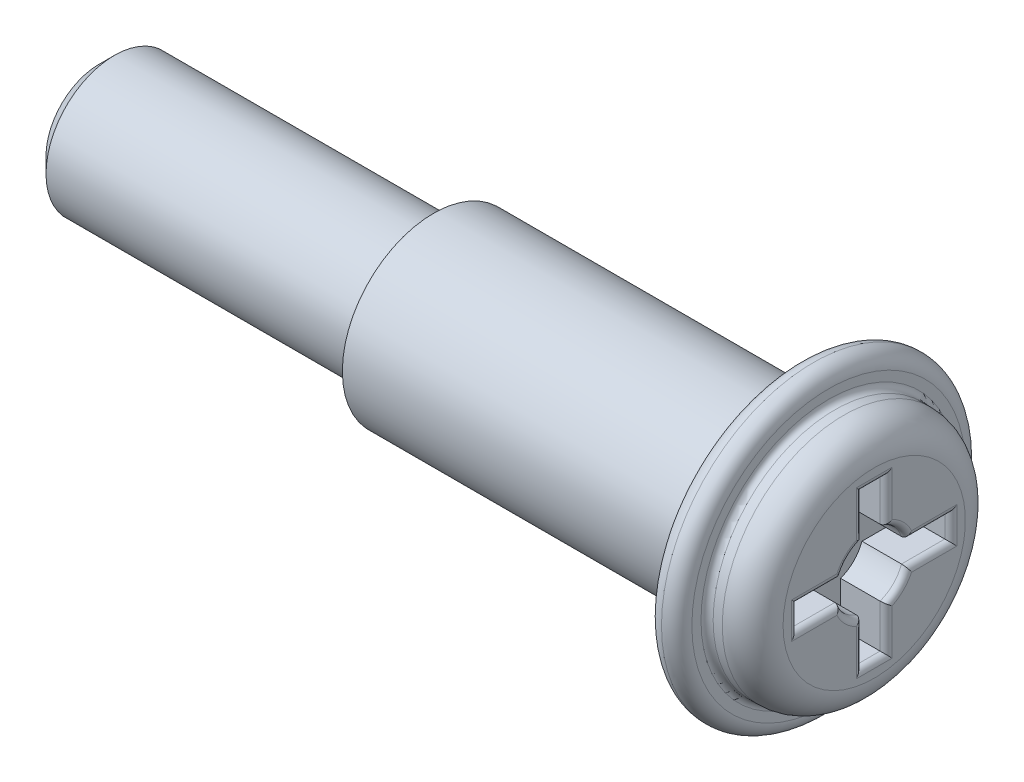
ISO-10303-21;
HEADER;
FILE_DESCRIPTION(('STEP AP214'),'2;1');
FILE_NAME('part.step','',(''),(''),'','','');
FILE_SCHEMA(('AUTOMOTIVE_DESIGN { 1 0 10303 214 1 1 1 1 }'));
ENDSEC;
DATA;
#1=APPLICATION_CONTEXT('core data for automotive mechanical design processes');
#2=APPLICATION_PROTOCOL_DEFINITION('international standard','automotive_design',2000,#1);
#3=PRODUCT_CONTEXT('',#1,'mechanical');
#4=PRODUCT('Part','Part','',(#3));
#5=PRODUCT_RELATED_PRODUCT_CATEGORY('part','',(#4));
#6=PRODUCT_DEFINITION_FORMATION('','',#4);
#7=PRODUCT_DEFINITION_CONTEXT('part definition',#1,'design');
#8=PRODUCT_DEFINITION('design','',#6,#7);
#9=PRODUCT_DEFINITION_SHAPE('','',#8);
#10=(LENGTH_UNIT() NAMED_UNIT(*) SI_UNIT(.MILLI.,.METRE.));
#11=(NAMED_UNIT(*) PLANE_ANGLE_UNIT() SI_UNIT($,.RADIAN.));
#12=(NAMED_UNIT(*) SI_UNIT($,.STERADIAN.) SOLID_ANGLE_UNIT());
#13=UNCERTAINTY_MEASURE_WITH_UNIT(LENGTH_MEASURE(1.E-05),#10,'distance_accuracy_value','');
#14=(GEOMETRIC_REPRESENTATION_CONTEXT(3) GLOBAL_UNCERTAINTY_ASSIGNED_CONTEXT((#13)) GLOBAL_UNIT_ASSIGNED_CONTEXT((#10,
#11,#12)) REPRESENTATION_CONTEXT('',''));
#15=CARTESIAN_POINT('',(0.,0.,0.));
#16=DIRECTION('',(0.,0.,1.));
#17=DIRECTION('',(1.,0.,0.));
#18=AXIS2_PLACEMENT_3D('',#15,#16,#17);
#19=CARTESIAN_POINT('',(25.5,2.99999999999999,0.));
#20=DIRECTION('',(-1.,0.,0.));
#21=DIRECTION('',(0.,0.,1.));
#22=AXIS2_PLACEMENT_3D('',#19,#20,#21);
#23=PLANE('',#22);
#24=DIRECTION('',(0.,0.,-1.));
#25=VECTOR('',#24,1.);
#26=CARTESIAN_POINT('',(25.5,-0.591802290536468,0.));
#27=LINE('',#26,#25);
#28=CARTESIAN_POINT('',(25.5,-0.591802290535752,1.22888879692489));
#29=VERTEX_POINT('',#28);
#30=CARTESIAN_POINT('',(25.5,-0.591802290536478,2.72097087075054));
#31=VERTEX_POINT('',#30);
#32=EDGE_CURVE('E316',#29,#31,#27,.F.);
#33=ORIENTED_EDGE('',*,*,#32,.T.);
#34=DIRECTION('',(0.,-1.,0.));
#35=VECTOR('',#34,1.);
#36=CARTESIAN_POINT('',(25.5,2.99999999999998,2.72097087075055));
#37=LINE('',#36,#35);
#38=CARTESIAN_POINT('',(25.5,0.591802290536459,2.72097087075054));
#39=VERTEX_POINT('',#38);
#40=EDGE_CURVE('E318',#31,#39,#37,.F.);
#41=ORIENTED_EDGE('',*,*,#40,.T.);
#42=DIRECTION('',(0.,0.,1.));
#43=VECTOR('',#42,1.);
#44=CARTESIAN_POINT('',(25.5,0.591802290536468,0.));
#45=LINE('',#44,#43);
#46=CARTESIAN_POINT('',(25.5,0.591802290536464,1.22888879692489));
#47=VERTEX_POINT('',#46);
#48=EDGE_CURVE('E288',#39,#47,#45,.F.);
#49=ORIENTED_EDGE('',*,*,#48,.T.);
#50=CARTESIAN_POINT('',(25.5,0.,0.));
#51=DIRECTION('',(-1.,0.,0.));
#52=DIRECTION('',(0.,0.,1.));
#53=AXIS2_PLACEMENT_3D('',#50,#51,#52);
#54=CIRCLE('',#53,1.36396393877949);
#55=CARTESIAN_POINT('',(25.5,1.22888879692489,0.591802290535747));
#56=VERTEX_POINT('',#55);
#57=EDGE_CURVE('E290',#47,#56,#54,.T.);
#58=ORIENTED_EDGE('',*,*,#57,.T.);
#59=DIRECTION('',(0.,-1.,0.));
#60=VECTOR('',#59,1.);
#61=CARTESIAN_POINT('',(25.5,2.99999999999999,0.591802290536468));
#62=LINE('',#61,#60);
#63=CARTESIAN_POINT('',(25.5,2.72097087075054,0.591802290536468));
#64=VERTEX_POINT('',#63);
#65=EDGE_CURVE('E292',#56,#64,#62,.F.);
#66=ORIENTED_EDGE('',*,*,#65,.T.);
#67=DIRECTION('',(0.,0.,1.));
#68=VECTOR('',#67,1.);
#69=CARTESIAN_POINT('',(25.5,2.72097087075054,0.));
#70=LINE('',#69,#68);
#71=CARTESIAN_POINT('',(25.5,2.72097087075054,-0.591802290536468));
#72=VERTEX_POINT('',#71);
#73=EDGE_CURVE('E294',#64,#72,#70,.F.);
#74=ORIENTED_EDGE('',*,*,#73,.T.);
#75=DIRECTION('',(0.,1.,0.));
#76=VECTOR('',#75,1.);
#77=CARTESIAN_POINT('',(25.5,2.99999999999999,-0.591802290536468));
#78=LINE('',#77,#76);
#79=CARTESIAN_POINT('',(25.5,1.22888879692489,-0.591802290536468));
#80=VERTEX_POINT('',#79);
#81=EDGE_CURVE('E296',#72,#80,#78,.F.);
#82=ORIENTED_EDGE('',*,*,#81,.T.);
#83=CARTESIAN_POINT('',(25.5,0.,0.));
#84=DIRECTION('',(-1.,0.,0.));
#85=DIRECTION('',(0.,0.,1.));
#86=AXIS2_PLACEMENT_3D('',#83,#84,#85);
#87=CIRCLE('',#86,1.36396393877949);
#88=CARTESIAN_POINT('',(25.5,0.591802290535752,-1.22888879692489));
#89=VERTEX_POINT('',#88);
#90=EDGE_CURVE('E298',#80,#89,#87,.T.);
#91=ORIENTED_EDGE('',*,*,#90,.T.);
#92=DIRECTION('',(0.,0.,1.));
#93=VECTOR('',#92,1.);
#94=CARTESIAN_POINT('',(25.5,0.591802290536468,0.));
#95=LINE('',#94,#93);
#96=CARTESIAN_POINT('',(25.5,0.591802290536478,-2.72097087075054));
#97=VERTEX_POINT('',#96);
#98=EDGE_CURVE('E300',#89,#97,#95,.F.);
#99=ORIENTED_EDGE('',*,*,#98,.T.);
#100=DIRECTION('',(0.,1.,0.));
#101=VECTOR('',#100,1.);
#102=CARTESIAN_POINT('',(25.5,3.00000000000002,-2.72097087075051));
#103=LINE('',#102,#101);
#104=CARTESIAN_POINT('',(25.5,-0.59180229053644,-2.72097087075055));
#105=VERTEX_POINT('',#104);
#106=EDGE_CURVE('E302',#97,#105,#103,.F.);
#107=ORIENTED_EDGE('',*,*,#106,.T.);
#108=DIRECTION('',(0.,0.,-1.));
#109=VECTOR('',#108,1.);
#110=CARTESIAN_POINT('',(25.5,-0.591802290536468,0.));
#111=LINE('',#110,#109);
#112=CARTESIAN_POINT('',(25.5,-0.591802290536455,-1.22888879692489));
#113=VERTEX_POINT('',#112);
#114=EDGE_CURVE('E304',#105,#113,#111,.F.);
#115=ORIENTED_EDGE('',*,*,#114,.T.);
#116=CARTESIAN_POINT('',(25.5,0.,0.));
#117=DIRECTION('',(-1.,0.,0.));
#118=DIRECTION('',(0.,0.,1.));
#119=AXIS2_PLACEMENT_3D('',#116,#117,#118);
#120=CIRCLE('',#119,1.36396393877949);
#121=CARTESIAN_POINT('',(25.5,-1.22888879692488,-0.591802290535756));
#122=VERTEX_POINT('',#121);
#123=EDGE_CURVE('E306',#113,#122,#120,.T.);
#124=ORIENTED_EDGE('',*,*,#123,.T.);
#125=DIRECTION('',(0.,1.,0.));
#126=VECTOR('',#125,1.);
#127=CARTESIAN_POINT('',(25.5,3.,-0.591802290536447));
#128=LINE('',#127,#126);
#129=CARTESIAN_POINT('',(25.5,-2.72097087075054,-0.591802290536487));
#130=VERTEX_POINT('',#129);
#131=EDGE_CURVE('E308',#122,#130,#128,.F.);
#132=ORIENTED_EDGE('',*,*,#131,.T.);
#133=DIRECTION('',(0.,0.,-1.));
#134=VECTOR('',#133,1.);
#135=CARTESIAN_POINT('',(25.5,-2.72097087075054,0.));
#136=LINE('',#135,#134);
#137=CARTESIAN_POINT('',(25.5,-2.72097087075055,0.591802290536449));
#138=VERTEX_POINT('',#137);
#139=EDGE_CURVE('E310',#130,#138,#136,.F.);
#140=ORIENTED_EDGE('',*,*,#139,.T.);
#141=DIRECTION('',(0.,-1.,0.));
#142=VECTOR('',#141,1.);
#143=CARTESIAN_POINT('',(25.5,2.99999999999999,0.591802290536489));
#144=LINE('',#143,#142);
#145=CARTESIAN_POINT('',(25.5,-1.22888879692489,0.59180229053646));
#146=VERTEX_POINT('',#145);
#147=EDGE_CURVE('E312',#138,#146,#144,.F.);
#148=ORIENTED_EDGE('',*,*,#147,.T.);
#149=CARTESIAN_POINT('',(25.5,0.,0.));
#150=DIRECTION('',(-1.,0.,0.));
#151=DIRECTION('',(0.,0.,1.));
#152=AXIS2_PLACEMENT_3D('',#149,#150,#151);
#153=CIRCLE('',#152,1.36396393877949);
#154=EDGE_CURVE('E314',#146,#29,#153,.T.);
#155=ORIENTED_EDGE('',*,*,#154,.T.);
#156=EDGE_LOOP('',(#33,#41,#49,#58,#66,#74,#82,#91,#99,#107,#115,#124,#132,#140,#148,#155));
#157=FACE_BOUND('',#156,.T.);
#158=CARTESIAN_POINT('',(25.5,0.,0.));
#159=DIRECTION('',(-1.,0.,0.));
#160=DIRECTION('',(0.,0.,1.));
#161=AXIS2_PLACEMENT_3D('',#158,#159,#160);
#162=CIRCLE('',#161,2.99999999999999);
#163=CARTESIAN_POINT('',(25.5,0.,2.99999999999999));
#164=VERTEX_POINT('',#163);
#165=EDGE_CURVE('E267',#164,#164,#162,.T.);
#166=ORIENTED_EDGE('',*,*,#165,.F.);
#167=EDGE_LOOP('',(#166));
#168=FACE_BOUND('',#167,.T.);
#169=ADVANCED_FACE('F33',(#157,#168),#23,.F.);
#170=CARTESIAN_POINT('',(24.5,0.,0.));
#171=DIRECTION('',(-1.,0.,0.));
#172=DIRECTION('',(0.,0.,1.));
#173=AXIS2_PLACEMENT_3D('',#170,#171,#172);
#174=TOROIDAL_SURFACE('',#173,3.,0.999999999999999);
#175=CARTESIAN_POINT('',(24.5,0.,0.));
#176=DIRECTION('',(-1.,0.,0.));
#177=DIRECTION('',(0.,0.,1.));
#178=AXIS2_PLACEMENT_3D('',#175,#176,#177);
#179=CIRCLE('',#178,4.);
#180=CARTESIAN_POINT('',(24.5,0.,4.));
#181=VERTEX_POINT('',#180);
#182=EDGE_CURVE('E264',#181,#181,#179,.T.);
#183=ORIENTED_EDGE('',*,*,#182,.F.);
#184=EDGE_LOOP('',(#183));
#185=FACE_BOUND('',#184,.T.);
#186=ORIENTED_EDGE('',*,*,#165,.T.);
#187=EDGE_LOOP('',(#186));
#188=FACE_BOUND('',#187,.T.);
#189=ADVANCED_FACE('F365',(#185,#188),#174,.T.);
#190=CARTESIAN_POINT('',(0.,0.,0.));
#191=DIRECTION('',(-1.,0.,0.));
#192=DIRECTION('',(0.,0.,1.));
#193=AXIS2_PLACEMENT_3D('',#190,#191,#192);
#194=CYLINDRICAL_SURFACE('',#193,4.);
#195=CARTESIAN_POINT('',(24.2,0.,0.));
#196=DIRECTION('',(-1.,0.,0.));
#197=DIRECTION('',(0.,0.,1.));
#198=AXIS2_PLACEMENT_3D('',#195,#196,#197);
#199=CIRCLE('',#198,4.);
#200=CARTESIAN_POINT('',(24.2,0.,4.));
#201=VERTEX_POINT('',#200);
#202=EDGE_CURVE('E279',#201,#201,#199,.F.);
#203=ORIENTED_EDGE('',*,*,#202,.T.);
#204=EDGE_LOOP('',(#203));
#205=FACE_BOUND('',#204,.T.);
#206=ORIENTED_EDGE('',*,*,#182,.T.);
#207=EDGE_LOOP('',(#206));
#208=FACE_BOUND('',#207,.T.);
#209=ADVANCED_FACE('F370',(#205,#208),#194,.T.);
#210=CARTESIAN_POINT('',(24.,5.,0.));
#211=DIRECTION('',(-1.,0.,0.));
#212=DIRECTION('',(0.,0.,1.));
#213=AXIS2_PLACEMENT_3D('',#210,#211,#212);
#214=PLANE('',#213);
#215=CARTESIAN_POINT('',(24.,0.,0.));
#216=DIRECTION('',(-1.,0.,0.));
#217=DIRECTION('',(0.,0.,1.));
#218=AXIS2_PLACEMENT_3D('',#215,#216,#217);
#219=CIRCLE('',#218,4.2);
#220=CARTESIAN_POINT('',(24.,0.,4.2));
#221=VERTEX_POINT('',#220);
#222=EDGE_CURVE('E276',#221,#221,#219,.T.);
#223=ORIENTED_EDGE('',*,*,#222,.T.);
#224=EDGE_LOOP('',(#223));
#225=FACE_BOUND('',#224,.T.);
#226=CARTESIAN_POINT('',(24.,0.,0.));
#227=DIRECTION('',(-1.,0.,0.));
#228=DIRECTION('',(0.,0.,1.));
#229=AXIS2_PLACEMENT_3D('',#226,#227,#228);
#230=CIRCLE('',#229,4.5);
#231=CARTESIAN_POINT('',(24.,0.,4.5));
#232=VERTEX_POINT('',#231);
#233=EDGE_CURVE('E270',#232,#232,#230,.F.);
#234=ORIENTED_EDGE('',*,*,#233,.T.);
#235=EDGE_LOOP('',(#234));
#236=FACE_BOUND('',#235,.T.);
#237=ADVANCED_FACE('F576',(#225,#236),#214,.F.);
#238=CARTESIAN_POINT('',(23.,3.,0.));
#239=DIRECTION('',(1.,0.,0.));
#240=DIRECTION('',(0.,0.,-1.));
#241=AXIS2_PLACEMENT_3D('',#238,#239,#240);
#242=PLANE('',#241);
#243=CARTESIAN_POINT('',(23.,0.,0.));
#244=DIRECTION('',(1.,0.,0.));
#245=DIRECTION('',(0.,0.,-1.));
#246=AXIS2_PLACEMENT_3D('',#243,#244,#245);
#247=CIRCLE('',#246,4.5);
#248=CARTESIAN_POINT('',(23.,0.,-4.5));
#249=VERTEX_POINT('',#248);
#250=EDGE_CURVE('E273',#249,#249,#247,.F.);
#251=ORIENTED_EDGE('',*,*,#250,.T.);
#252=EDGE_LOOP('',(#251));
#253=FACE_BOUND('',#252,.T.);
#254=CARTESIAN_POINT('',(23.,0.,0.));
#255=DIRECTION('',(-1.,0.,0.));
#256=DIRECTION('',(0.,0.,1.));
#257=AXIS2_PLACEMENT_3D('',#254,#255,#256);
#258=CIRCLE('',#257,3.);
#259=CARTESIAN_POINT('',(23.,0.,3.));
#260=VERTEX_POINT('',#259);
#261=EDGE_CURVE('E261',#260,#260,#258,.T.);
#262=ORIENTED_EDGE('',*,*,#261,.F.);
#263=EDGE_LOOP('',(#262));
#264=FACE_BOUND('',#263,.T.);
#265=ADVANCED_FACE('F572',(#253,#264),#242,.F.);
#266=CARTESIAN_POINT('',(0.,0.,0.));
#267=DIRECTION('',(-1.,0.,0.));
#268=DIRECTION('',(0.,0.,1.));
#269=AXIS2_PLACEMENT_3D('',#266,#267,#268);
#270=CYLINDRICAL_SURFACE('',#269,3.);
#271=CARTESIAN_POINT('',(11.,0.,0.));
#272=DIRECTION('',(-1.,0.,0.));
#273=DIRECTION('',(0.,0.,1.));
#274=AXIS2_PLACEMENT_3D('',#271,#272,#273);
#275=CIRCLE('',#274,3.);
#276=CARTESIAN_POINT('',(11.,0.,3.));
#277=VERTEX_POINT('',#276);
#278=EDGE_CURVE('E258',#277,#277,#275,.T.);
#279=ORIENTED_EDGE('',*,*,#278,.F.);
#280=EDGE_LOOP('',(#279));
#281=FACE_BOUND('',#280,.T.);
#282=ORIENTED_EDGE('',*,*,#261,.T.);
#283=EDGE_LOOP('',(#282));
#284=FACE_BOUND('',#283,.T.);
#285=ADVANCED_FACE('F568',(#281,#284),#270,.T.);
#286=CARTESIAN_POINT('',(11.,2.25,0.));
#287=DIRECTION('',(1.,0.,0.));
#288=DIRECTION('',(0.,0.,-1.));
#289=AXIS2_PLACEMENT_3D('',#286,#287,#288);
#290=PLANE('',#289);
#291=CARTESIAN_POINT('',(11.,0.,0.));
#292=DIRECTION('',(-1.,0.,0.));
#293=DIRECTION('',(0.,0.,1.));
#294=AXIS2_PLACEMENT_3D('',#291,#292,#293);
#295=CIRCLE('',#294,2.25);
#296=CARTESIAN_POINT('',(11.,0.,2.25));
#297=VERTEX_POINT('',#296);
#298=EDGE_CURVE('E255',#297,#297,#295,.T.);
#299=ORIENTED_EDGE('',*,*,#298,.F.);
#300=EDGE_LOOP('',(#299));
#301=FACE_BOUND('',#300,.T.);
#302=ORIENTED_EDGE('',*,*,#278,.T.);
#303=EDGE_LOOP('',(#302));
#304=FACE_BOUND('',#303,.T.);
#305=ADVANCED_FACE('F564',(#301,#304),#290,.F.);
#306=CARTESIAN_POINT('',(0.,0.,0.));
#307=DIRECTION('',(-1.,0.,0.));
#308=DIRECTION('',(0.,0.,1.));
#309=AXIS2_PLACEMENT_3D('',#306,#307,#308);
#310=CYLINDRICAL_SURFACE('',#309,2.25);
#311=CARTESIAN_POINT('',(0.500000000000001,0.,0.));
#312=DIRECTION('',(1.,0.,0.));
#313=DIRECTION('',(0.,0.,-1.));
#314=AXIS2_PLACEMENT_3D('',#311,#312,#313);
#315=CIRCLE('',#314,2.25);
#316=CARTESIAN_POINT('',(0.500000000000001,0.,-2.25));
#317=VERTEX_POINT('',#316);
#318=EDGE_CURVE('E11',#317,#317,#315,.T.);
#319=ORIENTED_EDGE('',*,*,#318,.T.);
#320=EDGE_LOOP('',(#319));
#321=FACE_BOUND('',#320,.T.);
#322=ORIENTED_EDGE('',*,*,#298,.T.);
#323=EDGE_LOOP('',(#322));
#324=FACE_BOUND('',#323,.T.);
#325=ADVANCED_FACE('F561',(#321,#324),#310,.T.);
#326=CARTESIAN_POINT('',(0.,0.,0.));
#327=DIRECTION('',(1.,0.,0.));
#328=DIRECTION('',(0.,0.,-1.));
#329=AXIS2_PLACEMENT_3D('',#326,#327,#328);
#330=PLANE('',#329);
#331=CARTESIAN_POINT('',(0.,0.,0.));
#332=DIRECTION('',(1.,0.,0.));
#333=DIRECTION('',(0.,0.,-1.));
#334=AXIS2_PLACEMENT_3D('',#331,#332,#333);
#335=CIRCLE('',#334,1.75);
#336=CARTESIAN_POINT('',(0.,0.,-1.75));
#337=VERTEX_POINT('',#336);
#338=EDGE_CURVE('E40',#337,#337,#335,.F.);
#339=ORIENTED_EDGE('',*,*,#338,.T.);
#340=EDGE_LOOP('',(#339));
#341=FACE_BOUND('',#340,.T.);
#342=ADVANCED_FACE('F350',(#341),#330,.F.);
#343=CARTESIAN_POINT('',(23.5,0.,0.));
#344=DIRECTION('',(1.,0.,0.));
#345=DIRECTION('',(0.,0.,-1.));
#346=AXIS2_PLACEMENT_3D('',#343,#344,#345);
#347=TOROIDAL_SURFACE('',#346,4.5,0.5);
#348=ORIENTED_EDGE('',*,*,#250,.F.);
#349=EDGE_LOOP('',(#348));
#350=FACE_BOUND('',#349,.T.);
#351=CARTESIAN_POINT('',(23.5,0.,0.));
#352=DIRECTION('',(1.,0.,0.));
#353=DIRECTION('',(0.,0.,-1.));
#354=AXIS2_PLACEMENT_3D('',#351,#352,#353);
#355=CIRCLE('',#354,5.);
#356=CARTESIAN_POINT('',(23.5,0.,-5.));
#357=VERTEX_POINT('',#356);
#358=EDGE_CURVE('E250',#357,#357,#355,.T.);
#359=ORIENTED_EDGE('',*,*,#358,.F.);
#360=EDGE_LOOP('',(#359));
#361=FACE_BOUND('',#360,.T.);
#362=ADVANCED_FACE('F554',(#350,#361),#347,.T.);
#363=CARTESIAN_POINT('',(23.5,0.,0.));
#364=DIRECTION('',(-1.,0.,0.));
#365=DIRECTION('',(0.,0.,1.));
#366=AXIS2_PLACEMENT_3D('',#363,#364,#365);
#367=TOROIDAL_SURFACE('',#366,4.5,0.5);
#368=ORIENTED_EDGE('',*,*,#233,.F.);
#369=EDGE_LOOP('',(#368));
#370=FACE_BOUND('',#369,.T.);
#371=ORIENTED_EDGE('',*,*,#358,.T.);
#372=EDGE_LOOP('',(#371));
#373=FACE_BOUND('',#372,.T.);
#374=ADVANCED_FACE('F550',(#370,#373),#367,.T.);
#375=CARTESIAN_POINT('',(24.2,0.,0.));
#376=DIRECTION('',(-1.,0.,0.));
#377=DIRECTION('',(0.,0.,1.));
#378=AXIS2_PLACEMENT_3D('',#375,#376,#377);
#379=TOROIDAL_SURFACE('',#378,4.2,0.2);
#380=ORIENTED_EDGE('',*,*,#202,.F.);
#381=EDGE_LOOP('',(#380));
#382=FACE_BOUND('',#381,.T.);
#383=ORIENTED_EDGE('',*,*,#222,.F.);
#384=EDGE_LOOP('',(#383));
#385=FACE_BOUND('',#384,.T.);
#386=ADVANCED_FACE('F547',(#382,#385),#379,.F.);
#387=CARTESIAN_POINT('',(24.,0.,0.391802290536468));
#388=DIRECTION('',(0.,0.,1.));
#389=DIRECTION('',(1.,0.,0.));
#390=AXIS2_PLACEMENT_3D('',#387,#388,#389);
#391=PLANE('',#390);
#392=DIRECTION('',(1.,0.,0.));
#393=VECTOR('',#392,1.);
#394=CARTESIAN_POINT('',(24.,2.52097087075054,0.391802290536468));
#395=LINE('',#394,#393);
#396=CARTESIAN_POINT('',(24.,2.52097087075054,0.391802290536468));
#397=VERTEX_POINT('',#396);
#398=CARTESIAN_POINT('',(25.3,2.52097087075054,0.391802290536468));
#399=VERTEX_POINT('',#398);
#400=EDGE_CURVE('E248',#397,#399,#395,.T.);
#401=ORIENTED_EDGE('',*,*,#400,.T.);
#402=DIRECTION('',(0.,-1.,0.));
#403=VECTOR('',#402,1.);
#404=CARTESIAN_POINT('',(25.3,0.,0.391802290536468));
#405=LINE('',#404,#403);
#406=CARTESIAN_POINT('',(25.3,1.09603969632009,0.391802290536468));
#407=VERTEX_POINT('',#406);
#408=EDGE_CURVE('E55',#399,#407,#405,.T.);
#409=ORIENTED_EDGE('',*,*,#408,.T.);
#410=DIRECTION('',(1.,0.,0.));
#411=VECTOR('',#410,1.);
#412=CARTESIAN_POINT('',(20.7078128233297,1.09603969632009,0.391802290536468));
#413=LINE('',#412,#411);
#414=CARTESIAN_POINT('',(24.,1.09603969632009,0.391802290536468));
#415=VERTEX_POINT('',#414);
#416=EDGE_CURVE('E959',#407,#415,#413,.F.);
#417=ORIENTED_EDGE('',*,*,#416,.T.);
#418=DIRECTION('',(0.,-1.,0.));
#419=VECTOR('',#418,1.);
#420=CARTESIAN_POINT('',(24.,0.,0.391802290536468));
#421=LINE('',#420,#419);
#422=EDGE_CURVE('E237',#397,#415,#421,.T.);
#423=ORIENTED_EDGE('',*,*,#422,.F.);
#424=EDGE_LOOP('',(#401,#409,#417,#423));
#425=FACE_BOUND('',#424,.T.);
#426=ADVANCED_FACE('F540',(#425),#391,.F.);
#427=CARTESIAN_POINT('',(24.,2.52097087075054,0.391802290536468));
#428=DIRECTION('',(0.,1.,0.));
#429=DIRECTION('',(0.,0.,1.));
#430=AXIS2_PLACEMENT_3D('',#427,#428,#429);
#431=PLANE('',#430);
#432=DIRECTION('',(1.,0.,0.));
#433=VECTOR('',#432,1.);
#434=CARTESIAN_POINT('',(24.,2.52097087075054,-0.391802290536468));
#435=LINE('',#434,#433);
#436=CARTESIAN_POINT('',(24.,2.52097087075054,-0.391802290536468));
#437=VERTEX_POINT('',#436);
#438=CARTESIAN_POINT('',(25.3,2.52097087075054,-0.391802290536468));
#439=VERTEX_POINT('',#438);
#440=EDGE_CURVE('E247',#437,#439,#435,.T.);
#441=ORIENTED_EDGE('',*,*,#440,.T.);
#442=DIRECTION('',(0.,0.,1.));
#443=VECTOR('',#442,1.);
#444=CARTESIAN_POINT('',(25.3,2.52097087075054,0.391802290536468));
#445=LINE('',#444,#443);
#446=EDGE_CURVE('E342',#439,#399,#445,.T.);
#447=ORIENTED_EDGE('',*,*,#446,.T.);
#448=ORIENTED_EDGE('',*,*,#400,.F.);
#449=DIRECTION('',(0.,0.,1.));
#450=VECTOR('',#449,1.);
#451=CARTESIAN_POINT('',(24.,2.52097087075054,0.391802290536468));
#452=LINE('',#451,#450);
#453=EDGE_CURVE('E244',#437,#397,#452,.T.);
#454=ORIENTED_EDGE('',*,*,#453,.F.);
#455=EDGE_LOOP('',(#441,#447,#448,#454));
#456=FACE_BOUND('',#455,.T.);
#457=ADVANCED_FACE('F537',(#456),#431,.F.);
#458=CARTESIAN_POINT('',(24.,0.,-0.391802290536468));
#459=DIRECTION('',(0.,0.,-1.));
#460=DIRECTION('',(-1.,0.,0.));
#461=AXIS2_PLACEMENT_3D('',#458,#459,#460);
#462=PLANE('',#461);
#463=DIRECTION('',(1.,0.,0.));
#464=VECTOR('',#463,1.);
#465=CARTESIAN_POINT('',(20.7078128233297,1.09603969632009,-0.391802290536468));
#466=LINE('',#465,#464);
#467=CARTESIAN_POINT('',(24.,1.09603969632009,-0.391802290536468));
#468=VERTEX_POINT('',#467);
#469=CARTESIAN_POINT('',(25.3,1.09603969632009,-0.391802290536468));
#470=VERTEX_POINT('',#469);
#471=EDGE_CURVE('E956',#468,#470,#466,.T.);
#472=ORIENTED_EDGE('',*,*,#471,.T.);
#473=DIRECTION('',(0.,1.,0.));
#474=VECTOR('',#473,1.);
#475=CARTESIAN_POINT('',(25.3,0.,-0.391802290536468));
#476=LINE('',#475,#474);
#477=EDGE_CURVE('E340',#470,#439,#476,.T.);
#478=ORIENTED_EDGE('',*,*,#477,.T.);
#479=ORIENTED_EDGE('',*,*,#440,.F.);
#480=DIRECTION('',(0.,1.,0.));
#481=VECTOR('',#480,1.);
#482=CARTESIAN_POINT('',(24.,0.,-0.391802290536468));
#483=LINE('',#482,#481);
#484=EDGE_CURVE('E242',#468,#437,#483,.T.);
#485=ORIENTED_EDGE('',*,*,#484,.F.);
#486=EDGE_LOOP('',(#472,#478,#479,#485));
#487=FACE_BOUND('',#486,.T.);
#488=ADVANCED_FACE('F536',(#487),#462,.F.);
#489=CARTESIAN_POINT('',(24.,2.52097087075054,0.391802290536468));
#490=DIRECTION('',(-1.,0.,0.));
#491=DIRECTION('',(0.,0.,1.));
#492=AXIS2_PLACEMENT_3D('',#489,#490,#491);
#493=PLANE('',#492);
#494=CARTESIAN_POINT('',(24.,0.,0.));
#495=DIRECTION('',(-1.,0.,0.));
#496=DIRECTION('',(0.,0.,1.));
#497=AXIS2_PLACEMENT_3D('',#494,#495,#496);
#498=CIRCLE('',#497,1.16396393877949);
#499=CARTESIAN_POINT('',(24.,0.391802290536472,-1.09603969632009));
#500=VERTEX_POINT('',#499);
#501=EDGE_CURVE('E948',#500,#468,#498,.F.);
#502=ORIENTED_EDGE('',*,*,#501,.T.);
#503=ORIENTED_EDGE('',*,*,#484,.T.);
#504=ORIENTED_EDGE('',*,*,#453,.T.);
#505=ORIENTED_EDGE('',*,*,#422,.T.);
#506=CARTESIAN_POINT('',(24.,0.391802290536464,1.09603969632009));
#507=VERTEX_POINT('',#506);
#508=EDGE_CURVE('E217',#415,#507,#498,.F.);
#509=ORIENTED_EDGE('',*,*,#508,.T.);
#510=DIRECTION('',(0.,0.,1.));
#511=VECTOR('',#510,1.);
#512=CARTESIAN_POINT('',(24.,0.391802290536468,0.));
#513=LINE('',#512,#511);
#514=CARTESIAN_POINT('',(24.,0.391802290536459,2.52097087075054));
#515=VERTEX_POINT('',#514);
#516=EDGE_CURVE('E222',#507,#515,#513,.T.);
#517=ORIENTED_EDGE('',*,*,#516,.T.);
#518=DIRECTION('',(0.,-1.,0.));
#519=VECTOR('',#518,1.);
#520=CARTESIAN_POINT('',(24.,-0.391802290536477,2.52097087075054));
#521=LINE('',#520,#519);
#522=CARTESIAN_POINT('',(24.,-0.391802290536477,2.52097087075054));
#523=VERTEX_POINT('',#522);
#524=EDGE_CURVE('E221',#515,#523,#521,.T.);
#525=ORIENTED_EDGE('',*,*,#524,.T.);
#526=DIRECTION('',(0.,0.,-1.));
#527=VECTOR('',#526,1.);
#528=CARTESIAN_POINT('',(24.,-0.391802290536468,0.));
#529=LINE('',#528,#527);
#530=CARTESIAN_POINT('',(24.,-0.391802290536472,1.09603969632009));
#531=VERTEX_POINT('',#530);
#532=EDGE_CURVE('E199',#523,#531,#529,.T.);
#533=ORIENTED_EDGE('',*,*,#532,.T.);
#534=CARTESIAN_POINT('',(24.,-1.09603969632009,0.391802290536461));
#535=VERTEX_POINT('',#534);
#536=EDGE_CURVE('E209',#531,#535,#498,.F.);
#537=ORIENTED_EDGE('',*,*,#536,.T.);
#538=DIRECTION('',(0.,-1.,0.));
#539=VECTOR('',#538,1.);
#540=CARTESIAN_POINT('',(24.,0.,0.391802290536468));
#541=LINE('',#540,#539);
#542=CARTESIAN_POINT('',(24.,-2.52097087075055,0.391802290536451));
#543=VERTEX_POINT('',#542);
#544=EDGE_CURVE('E975',#535,#543,#541,.T.);
#545=ORIENTED_EDGE('',*,*,#544,.T.);
#546=DIRECTION('',(0.,0.,-1.));
#547=VECTOR('',#546,1.);
#548=CARTESIAN_POINT('',(24.,-2.52097087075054,-0.391802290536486));
#549=LINE('',#548,#547);
#550=CARTESIAN_POINT('',(24.,-2.52097087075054,-0.391802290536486));
#551=VERTEX_POINT('',#550);
#552=EDGE_CURVE('E977',#543,#551,#549,.T.);
#553=ORIENTED_EDGE('',*,*,#552,.T.);
#554=DIRECTION('',(0.,1.,0.));
#555=VECTOR('',#554,1.);
#556=CARTESIAN_POINT('',(24.,0.,-0.391802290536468));
#557=LINE('',#556,#555);
#558=CARTESIAN_POINT('',(24.,-1.09603969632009,-0.391802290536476));
#559=VERTEX_POINT('',#558);
#560=EDGE_CURVE('E970',#551,#559,#557,.T.);
#561=ORIENTED_EDGE('',*,*,#560,.T.);
#562=CARTESIAN_POINT('',(24.,-0.391802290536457,-1.0960396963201));
#563=VERTEX_POINT('',#562);
#564=EDGE_CURVE('E215',#559,#563,#498,.F.);
#565=ORIENTED_EDGE('',*,*,#564,.T.);
#566=DIRECTION('',(0.,0.,-1.));
#567=VECTOR('',#566,1.);
#568=CARTESIAN_POINT('',(24.,-0.391802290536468,0.));
#569=LINE('',#568,#567);
#570=CARTESIAN_POINT('',(24.,-0.391802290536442,-2.52097087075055));
#571=VERTEX_POINT('',#570);
#572=EDGE_CURVE('E961',#563,#571,#569,.T.);
#573=ORIENTED_EDGE('',*,*,#572,.T.);
#574=DIRECTION('',(0.,1.,0.));
#575=VECTOR('',#574,1.);
#576=CARTESIAN_POINT('',(24.,0.391802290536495,-2.52097087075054));
#577=LINE('',#576,#575);
#578=CARTESIAN_POINT('',(24.,0.391802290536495,-2.52097087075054));
#579=VERTEX_POINT('',#578);
#580=EDGE_CURVE('E963',#571,#579,#577,.T.);
#581=ORIENTED_EDGE('',*,*,#580,.T.);
#582=EDGE_CURVE('E225',#579,#500,#513,.T.);
#583=ORIENTED_EDGE('',*,*,#582,.T.);
#584=EDGE_LOOP('',(#502,#503,#504,#505,#509,#517,#525,#533,#537,#545,#553,#561,#565,#573,#581,#583));
#585=FACE_BOUND('',#584,.T.);
#586=ADVANCED_FACE('F219',(#585),#493,.F.);
#587=CARTESIAN_POINT('',(24.,0.391802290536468,0.));
#588=DIRECTION('',(0.,1.,0.));
#589=DIRECTION('',(0.,0.,1.));
#590=AXIS2_PLACEMENT_3D('',#587,#588,#589);
#591=PLANE('',#590);
#592=DIRECTION('',(1.,0.,0.));
#593=VECTOR('',#592,1.);
#594=CARTESIAN_POINT('',(20.7078128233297,0.391802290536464,1.09603969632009));
#595=LINE('',#594,#593);
#596=CARTESIAN_POINT('',(25.3,0.391802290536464,1.09603969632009));
#597=VERTEX_POINT('',#596);
#598=EDGE_CURVE('E954',#507,#597,#595,.T.);
#599=ORIENTED_EDGE('',*,*,#598,.T.);
#600=DIRECTION('',(0.,0.,1.));
#601=VECTOR('',#600,1.);
#602=CARTESIAN_POINT('',(25.3,0.391802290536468,0.));
#603=LINE('',#602,#601);
#604=CARTESIAN_POINT('',(25.3,0.391802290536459,2.52097087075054));
#605=VERTEX_POINT('',#604);
#606=EDGE_CURVE('E346',#597,#605,#603,.T.);
#607=ORIENTED_EDGE('',*,*,#606,.T.);
#608=DIRECTION('',(1.,0.,0.));
#609=VECTOR('',#608,1.);
#610=CARTESIAN_POINT('',(24.,0.391802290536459,2.52097087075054));
#611=LINE('',#610,#609);
#612=EDGE_CURVE('E234',#515,#605,#611,.T.);
#613=ORIENTED_EDGE('',*,*,#612,.F.);
#614=ORIENTED_EDGE('',*,*,#516,.F.);
#615=EDGE_LOOP('',(#599,#607,#613,#614));
#616=FACE_BOUND('',#615,.T.);
#617=ADVANCED_FACE('F527',(#616),#591,.F.);
#618=DIRECTION('',(1.,0.,0.));
#619=VECTOR('',#618,1.);
#620=CARTESIAN_POINT('',(24.,0.391802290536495,-2.52097087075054));
#621=LINE('',#620,#619);
#622=CARTESIAN_POINT('',(25.3,0.391802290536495,-2.52097087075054));
#623=VERTEX_POINT('',#622);
#624=EDGE_CURVE('E967',#579,#623,#621,.T.);
#625=ORIENTED_EDGE('',*,*,#624,.T.);
#626=DIRECTION('',(0.,0.,1.));
#627=VECTOR('',#626,1.);
#628=CARTESIAN_POINT('',(25.3,0.391802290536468,0.));
#629=LINE('',#628,#627);
#630=CARTESIAN_POINT('',(25.3,0.391802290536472,-1.09603969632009));
#631=VERTEX_POINT('',#630);
#632=EDGE_CURVE('E336',#623,#631,#629,.T.);
#633=ORIENTED_EDGE('',*,*,#632,.T.);
#634=DIRECTION('',(1.,0.,0.));
#635=VECTOR('',#634,1.);
#636=CARTESIAN_POINT('',(20.7078128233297,0.391802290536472,-1.09603969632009));
#637=LINE('',#636,#635);
#638=EDGE_CURVE('E205',#631,#500,#637,.F.);
#639=ORIENTED_EDGE('',*,*,#638,.T.);
#640=ORIENTED_EDGE('',*,*,#582,.F.);
#641=EDGE_LOOP('',(#625,#633,#639,#640));
#642=FACE_BOUND('',#641,.T.);
#643=ADVANCED_FACE('F530',(#642),#591,.F.);
#644=CARTESIAN_POINT('',(24.,-0.391802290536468,0.));
#645=DIRECTION('',(0.,-1.,0.));
#646=DIRECTION('',(0.,0.,-1.));
#647=AXIS2_PLACEMENT_3D('',#644,#645,#646);
#648=PLANE('',#647);
#649=DIRECTION('',(1.,0.,0.));
#650=VECTOR('',#649,1.);
#651=CARTESIAN_POINT('',(24.,-0.391802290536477,2.52097087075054));
#652=LINE('',#651,#650);
#653=CARTESIAN_POINT('',(25.3,-0.391802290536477,2.52097087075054));
#654=VERTEX_POINT('',#653);
#655=EDGE_CURVE('E235',#523,#654,#652,.T.);
#656=ORIENTED_EDGE('',*,*,#655,.T.);
#657=DIRECTION('',(0.,0.,-1.));
#658=VECTOR('',#657,1.);
#659=CARTESIAN_POINT('',(25.3,-0.391802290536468,0.));
#660=LINE('',#659,#658);
#661=CARTESIAN_POINT('',(25.3,-0.391802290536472,1.09603969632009));
#662=VERTEX_POINT('',#661);
#663=EDGE_CURVE('E202',#654,#662,#660,.T.);
#664=ORIENTED_EDGE('',*,*,#663,.T.);
#665=DIRECTION('',(1.,0.,0.));
#666=VECTOR('',#665,1.);
#667=CARTESIAN_POINT('',(20.7078128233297,-0.391802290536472,1.09603969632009));
#668=LINE('',#667,#666);
#669=EDGE_CURVE('E194',#662,#531,#668,.F.);
#670=ORIENTED_EDGE('',*,*,#669,.T.);
#671=ORIENTED_EDGE('',*,*,#532,.F.);
#672=EDGE_LOOP('',(#656,#664,#670,#671));
#673=FACE_BOUND('',#672,.T.);
#674=ADVANCED_FACE('F197',(#673),#648,.F.);
#675=CARTESIAN_POINT('',(24.,-0.391802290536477,2.52097087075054));
#676=DIRECTION('',(0.,0.,1.));
#677=DIRECTION('',(0.,-1.,0.));
#678=AXIS2_PLACEMENT_3D('',#675,#676,#677);
#679=PLANE('',#678);
#680=ORIENTED_EDGE('',*,*,#612,.T.);
#681=DIRECTION('',(0.,-1.,0.));
#682=VECTOR('',#681,1.);
#683=CARTESIAN_POINT('',(25.3,-0.391802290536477,2.52097087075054));
#684=LINE('',#683,#682);
#685=EDGE_CURVE('E285',#605,#654,#684,.T.);
#686=ORIENTED_EDGE('',*,*,#685,.T.);
#687=ORIENTED_EDGE('',*,*,#655,.F.);
#688=ORIENTED_EDGE('',*,*,#524,.F.);
#689=EDGE_LOOP('',(#680,#686,#687,#688));
#690=FACE_BOUND('',#689,.T.);
#691=ADVANCED_FACE('F522',(#690),#679,.F.);
#692=CARTESIAN_POINT('',(24.,0.,-0.391802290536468));
#693=DIRECTION('',(0.,0.,-1.));
#694=DIRECTION('',(0.,1.,0.));
#695=AXIS2_PLACEMENT_3D('',#692,#693,#694);
#696=PLANE('',#695);
#697=DIRECTION('',(1.,0.,0.));
#698=VECTOR('',#697,1.);
#699=CARTESIAN_POINT('',(24.,-2.52097087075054,-0.391802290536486));
#700=LINE('',#699,#698);
#701=CARTESIAN_POINT('',(25.3,-2.52097087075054,-0.391802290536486));
#702=VERTEX_POINT('',#701);
#703=EDGE_CURVE('E223',#551,#702,#700,.T.);
#704=ORIENTED_EDGE('',*,*,#703,.T.);
#705=DIRECTION('',(0.,1.,0.));
#706=VECTOR('',#705,1.);
#707=CARTESIAN_POINT('',(25.3,0.,-0.391802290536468));
#708=LINE('',#707,#706);
#709=CARTESIAN_POINT('',(25.3,-1.09603969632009,-0.391802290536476));
#710=VERTEX_POINT('',#709);
#711=EDGE_CURVE('E328',#702,#710,#708,.T.);
#712=ORIENTED_EDGE('',*,*,#711,.T.);
#713=DIRECTION('',(1.,0.,0.));
#714=VECTOR('',#713,1.);
#715=CARTESIAN_POINT('',(20.7078128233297,-1.09603969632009,-0.391802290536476));
#716=LINE('',#715,#714);
#717=EDGE_CURVE('E206',#710,#559,#716,.F.);
#718=ORIENTED_EDGE('',*,*,#717,.T.);
#719=ORIENTED_EDGE('',*,*,#560,.F.);
#720=EDGE_LOOP('',(#704,#712,#718,#719));
#721=FACE_BOUND('',#720,.T.);
#722=ADVANCED_FACE('F515',(#721),#696,.F.);
#723=CARTESIAN_POINT('',(24.,-2.52097087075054,-0.391802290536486));
#724=DIRECTION('',(0.,-1.,0.));
#725=DIRECTION('',(0.,0.,-1.));
#726=AXIS2_PLACEMENT_3D('',#723,#724,#725);
#727=PLANE('',#726);
#728=DIRECTION('',(1.,0.,0.));
#729=VECTOR('',#728,1.);
#730=CARTESIAN_POINT('',(24.,-2.52097087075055,0.391802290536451));
#731=LINE('',#730,#729);
#732=CARTESIAN_POINT('',(25.3,-2.52097087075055,0.391802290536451));
#733=VERTEX_POINT('',#732);
#734=EDGE_CURVE('E228',#543,#733,#731,.T.);
#735=ORIENTED_EDGE('',*,*,#734,.T.);
#736=DIRECTION('',(0.,0.,-1.));
#737=VECTOR('',#736,1.);
#738=CARTESIAN_POINT('',(25.3,-2.52097087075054,-0.391802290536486));
#739=LINE('',#738,#737);
#740=EDGE_CURVE('E326',#733,#702,#739,.T.);
#741=ORIENTED_EDGE('',*,*,#740,.T.);
#742=ORIENTED_EDGE('',*,*,#703,.F.);
#743=ORIENTED_EDGE('',*,*,#552,.F.);
#744=EDGE_LOOP('',(#735,#741,#742,#743));
#745=FACE_BOUND('',#744,.T.);
#746=ADVANCED_FACE('F512',(#745),#727,.F.);
#747=CARTESIAN_POINT('',(24.,0.,0.391802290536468));
#748=DIRECTION('',(0.,0.,1.));
#749=DIRECTION('',(0.,-1.,0.));
#750=AXIS2_PLACEMENT_3D('',#747,#748,#749);
#751=PLANE('',#750);
#752=DIRECTION('',(1.,0.,0.));
#753=VECTOR('',#752,1.);
#754=CARTESIAN_POINT('',(20.7078128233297,-1.09603969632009,0.391802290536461));
#755=LINE('',#754,#753);
#756=CARTESIAN_POINT('',(25.3,-1.09603969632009,0.391802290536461));
#757=VERTEX_POINT('',#756);
#758=EDGE_CURVE('E212',#535,#757,#755,.T.);
#759=ORIENTED_EDGE('',*,*,#758,.T.);
#760=DIRECTION('',(0.,-1.,0.));
#761=VECTOR('',#760,1.);
#762=CARTESIAN_POINT('',(25.3,0.,0.391802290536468));
#763=LINE('',#762,#761);
#764=EDGE_CURVE('E324',#757,#733,#763,.T.);
#765=ORIENTED_EDGE('',*,*,#764,.T.);
#766=ORIENTED_EDGE('',*,*,#734,.F.);
#767=ORIENTED_EDGE('',*,*,#544,.F.);
#768=EDGE_LOOP('',(#759,#765,#766,#767));
#769=FACE_BOUND('',#768,.T.);
#770=ADVANCED_FACE('F507',(#769),#751,.F.);
#771=CARTESIAN_POINT('',(24.,0.391802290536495,-2.52097087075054));
#772=DIRECTION('',(0.,0.,-1.));
#773=DIRECTION('',(0.,1.,0.));
#774=AXIS2_PLACEMENT_3D('',#771,#772,#773);
#775=PLANE('',#774);
#776=DIRECTION('',(1.,0.,0.));
#777=VECTOR('',#776,1.);
#778=CARTESIAN_POINT('',(24.,-0.391802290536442,-2.52097087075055));
#779=LINE('',#778,#777);
#780=CARTESIAN_POINT('',(25.3,-0.391802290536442,-2.52097087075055));
#781=VERTEX_POINT('',#780);
#782=EDGE_CURVE('E966',#571,#781,#779,.T.);
#783=ORIENTED_EDGE('',*,*,#782,.T.);
#784=DIRECTION('',(0.,1.,0.));
#785=VECTOR('',#784,1.);
#786=CARTESIAN_POINT('',(25.3,0.391802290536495,-2.52097087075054));
#787=LINE('',#786,#785);
#788=EDGE_CURVE('E334',#781,#623,#787,.T.);
#789=ORIENTED_EDGE('',*,*,#788,.T.);
#790=ORIENTED_EDGE('',*,*,#624,.F.);
#791=ORIENTED_EDGE('',*,*,#580,.F.);
#792=EDGE_LOOP('',(#783,#789,#790,#791));
#793=FACE_BOUND('',#792,.T.);
#794=ADVANCED_FACE('F503',(#793),#775,.F.);
#795=CARTESIAN_POINT('',(24.,-0.391802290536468,0.));
#796=DIRECTION('',(0.,-1.,0.));
#797=DIRECTION('',(0.,0.,-1.));
#798=AXIS2_PLACEMENT_3D('',#795,#796,#797);
#799=PLANE('',#798);
#800=DIRECTION('',(1.,0.,0.));
#801=VECTOR('',#800,1.);
#802=CARTESIAN_POINT('',(20.7078128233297,-0.391802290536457,-1.0960396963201));
#803=LINE('',#802,#801);
#804=CARTESIAN_POINT('',(25.3,-0.391802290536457,-1.0960396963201));
#805=VERTEX_POINT('',#804);
#806=EDGE_CURVE('E282',#563,#805,#803,.T.);
#807=ORIENTED_EDGE('',*,*,#806,.T.);
#808=DIRECTION('',(0.,0.,-1.));
#809=VECTOR('',#808,1.);
#810=CARTESIAN_POINT('',(25.3,-0.391802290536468,0.));
#811=LINE('',#810,#809);
#812=EDGE_CURVE('E332',#805,#781,#811,.T.);
#813=ORIENTED_EDGE('',*,*,#812,.T.);
#814=ORIENTED_EDGE('',*,*,#782,.F.);
#815=ORIENTED_EDGE('',*,*,#572,.F.);
#816=EDGE_LOOP('',(#807,#813,#814,#815));
#817=FACE_BOUND('',#816,.T.);
#818=ADVANCED_FACE('F506',(#817),#799,.F.);
#819=CARTESIAN_POINT('',(20.7078128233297,0.,0.));
#820=DIRECTION('',(1.,0.,0.));
#821=DIRECTION('',(0.,0.,-1.));
#822=AXIS2_PLACEMENT_3D('',#819,#820,#821);
#823=CYLINDRICAL_SURFACE('',#822,1.16396393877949);
#824=ORIENTED_EDGE('',*,*,#717,.F.);
#825=CARTESIAN_POINT('',(25.3,0.,0.));
#826=DIRECTION('',(-1.,0.,0.));
#827=DIRECTION('',(0.,0.,1.));
#828=AXIS2_PLACEMENT_3D('',#825,#826,#827);
#829=CIRCLE('',#828,1.16396393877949);
#830=EDGE_CURVE('E330',#710,#805,#829,.F.);
#831=ORIENTED_EDGE('',*,*,#830,.T.);
#832=ORIENTED_EDGE('',*,*,#806,.F.);
#833=ORIENTED_EDGE('',*,*,#564,.F.);
#834=EDGE_LOOP('',(#824,#831,#832,#833));
#835=FACE_BOUND('',#834,.T.);
#836=ADVANCED_FACE('F502',(#835),#823,.F.);
#837=ORIENTED_EDGE('',*,*,#669,.F.);
#838=CARTESIAN_POINT('',(25.3,0.,0.));
#839=DIRECTION('',(-1.,0.,0.));
#840=DIRECTION('',(0.,0.,1.));
#841=AXIS2_PLACEMENT_3D('',#838,#839,#840);
#842=CIRCLE('',#841,1.16396393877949);
#843=EDGE_CURVE('E322',#662,#757,#842,.F.);
#844=ORIENTED_EDGE('',*,*,#843,.T.);
#845=ORIENTED_EDGE('',*,*,#758,.F.);
#846=ORIENTED_EDGE('',*,*,#536,.F.);
#847=EDGE_LOOP('',(#837,#844,#845,#846));
#848=FACE_BOUND('',#847,.T.);
#849=ADVANCED_FACE('F210',(#848),#823,.F.);
#850=ORIENTED_EDGE('',*,*,#638,.F.);
#851=CARTESIAN_POINT('',(25.3,0.,0.));
#852=DIRECTION('',(-1.,0.,0.));
#853=DIRECTION('',(0.,0.,1.));
#854=AXIS2_PLACEMENT_3D('',#851,#852,#853);
#855=CIRCLE('',#854,1.16396393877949);
#856=EDGE_CURVE('E338',#631,#470,#855,.F.);
#857=ORIENTED_EDGE('',*,*,#856,.T.);
#858=ORIENTED_EDGE('',*,*,#471,.F.);
#859=ORIENTED_EDGE('',*,*,#501,.F.);
#860=EDGE_LOOP('',(#850,#857,#858,#859));
#861=FACE_BOUND('',#860,.T.);
#862=ADVANCED_FACE('F501',(#861),#823,.F.);
#863=ORIENTED_EDGE('',*,*,#416,.F.);
#864=CARTESIAN_POINT('',(25.3,0.,0.));
#865=DIRECTION('',(-1.,0.,0.));
#866=DIRECTION('',(0.,0.,1.));
#867=AXIS2_PLACEMENT_3D('',#864,#865,#866);
#868=CIRCLE('',#867,1.16396393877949);
#869=EDGE_CURVE('E47',#407,#597,#868,.F.);
#870=ORIENTED_EDGE('',*,*,#869,.T.);
#871=ORIENTED_EDGE('',*,*,#598,.F.);
#872=ORIENTED_EDGE('',*,*,#508,.F.);
#873=EDGE_LOOP('',(#863,#870,#871,#872));
#874=FACE_BOUND('',#873,.T.);
#875=ADVANCED_FACE('F497',(#874),#823,.F.);
#876=CARTESIAN_POINT('',(25.3,0.391802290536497,-2.72097087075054));
#877=DIRECTION('',(0.,1.,0.));
#878=DIRECTION('',(0.,0.,1.));
#879=AXIS2_PLACEMENT_3D('',#876,#877,#878);
#880=CYLINDRICAL_SURFACE('',#879,0.2);
#881=CARTESIAN_POINT('',(25.3,-0.59180229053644,-2.72097087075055));
#882=DIRECTION('',(0.,0.707106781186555,-0.70710678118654));
#883=DIRECTION('',(0.,-0.70710678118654,-0.707106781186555));
#884=AXIS2_PLACEMENT_3D('',#881,#882,#883);
#885=ELLIPSE('',#884,0.282842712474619,0.2);
#886=EDGE_CURVE('E945',#105,#781,#885,.F.);
#887=ORIENTED_EDGE('',*,*,#886,.F.);
#888=ORIENTED_EDGE('',*,*,#106,.F.);
#889=CARTESIAN_POINT('',(25.3,0.591802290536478,-2.72097087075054));
#890=DIRECTION('',(0.,0.707106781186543,0.707106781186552));
#891=DIRECTION('',(0.,0.707106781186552,-0.707106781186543));
#892=AXIS2_PLACEMENT_3D('',#889,#890,#891);
#893=ELLIPSE('',#892,0.282842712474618,0.2);
#894=EDGE_CURVE('E943',#623,#97,#893,.T.);
#895=ORIENTED_EDGE('',*,*,#894,.F.);
#896=ORIENTED_EDGE('',*,*,#788,.F.);
#897=EDGE_LOOP('',(#887,#888,#895,#896));
#898=FACE_BOUND('',#897,.T.);
#899=ADVANCED_FACE('F493',(#898),#880,.T.);
#900=CARTESIAN_POINT('',(25.3,0.591802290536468,0.));
#901=DIRECTION('',(0.,0.,1.));
#902=DIRECTION('',(0.,-1.,0.));
#903=AXIS2_PLACEMENT_3D('',#900,#901,#902);
#904=CYLINDRICAL_SURFACE('',#903,0.2);
#905=ORIENTED_EDGE('',*,*,#894,.T.);
#906=ORIENTED_EDGE('',*,*,#98,.F.);
#907=CARTESIAN_POINT('',(25.3,0.391802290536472,-1.09603969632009));
#908=CARTESIAN_POINT('',(25.3098410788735,0.391788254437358,-1.09602854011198));
#909=CARTESIAN_POINT('',(25.3196663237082,0.392527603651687,-1.09655070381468));
#910=CARTESIAN_POINT('',(25.3389530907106,0.395395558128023,-1.0985690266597));
#911=CARTESIAN_POINT('',(25.3484163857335,0.39751611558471,-1.10005954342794));
#912=CARTESIAN_POINT('',(25.3667530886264,0.403027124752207,-1.10392085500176));
#913=CARTESIAN_POINT('',(25.3756273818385,0.406415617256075,-1.10629029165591));
#914=CARTESIAN_POINT('',(25.3926285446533,0.414297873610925,-1.11177832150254));
#915=CARTESIAN_POINT('',(25.4007544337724,0.418793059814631,-1.114897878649));
#916=CARTESIAN_POINT('',(25.4166736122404,0.429065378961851,-1.12199048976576));
#917=CARTESIAN_POINT('',(25.4244025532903,0.434910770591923,-1.12600835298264));
#918=CARTESIAN_POINT('',(25.4387738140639,0.447465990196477,-1.13458546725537));
#919=CARTESIAN_POINT('',(25.4454159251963,0.454175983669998,-1.13914482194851));
#920=CARTESIAN_POINT('',(25.4586380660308,0.469517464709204,-1.149500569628));
#921=CARTESIAN_POINT('',(25.4650055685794,0.478280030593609,-1.15537407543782));
#922=CARTESIAN_POINT('',(25.4761715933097,0.49652286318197,-1.16750260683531));
#923=CARTESIAN_POINT('',(25.4809679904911,0.506004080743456,-1.17375813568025));
#924=CARTESIAN_POINT('',(25.489803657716,0.52749001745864,-1.18781637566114));
#925=CARTESIAN_POINT('',(25.4934798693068,0.539610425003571,-1.19567100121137));
#926=CARTESIAN_POINT('',(25.4984884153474,0.56423912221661,-1.211471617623));
#927=CARTESIAN_POINT('',(25.4998259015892,0.576746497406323,-1.21941736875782));
#928=CARTESIAN_POINT('',(25.4999947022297,0.590120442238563,-1.22783168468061));
#929=CARTESIAN_POINT('',(25.50000000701,0.590961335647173,-1.2283603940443));
#930=CARTESIAN_POINT('',(25.5,0.591802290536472,-1.22888879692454));
#931=B_SPLINE_CURVE_WITH_KNOTS('',3,(#907,#908,#909,#910,#911,#912,#913,#914,#915,#916,#917,
#918,#919,#920,#921,#922,#923,#924,#925,#926,#927,#928,#929,#930),.UNSPECIFIED.,.F.,.F.,(4,2,2,
2,2,2,2,2,2,2,2,4),(0.,0.0294566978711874,0.0587432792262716,0.0879847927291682,
0.117264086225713,0.148617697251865,0.179977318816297,0.216801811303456,0.25367590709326,
0.298193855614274,0.342613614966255,0.345593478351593),.UNSPECIFIED.);
#932=EDGE_CURVE('E473',#631,#89,#931,.T.);
#933=ORIENTED_EDGE('',*,*,#932,.F.);
#934=ORIENTED_EDGE('',*,*,#632,.F.);
#935=EDGE_LOOP('',(#905,#906,#933,#934));
#936=FACE_BOUND('',#935,.T.);
#937=ADVANCED_FACE('F487',(#936),#904,.T.);
#938=CARTESIAN_POINT('',(25.3,-0.591802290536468,0.));
#939=DIRECTION('',(0.,0.,-1.));
#940=DIRECTION('',(0.,1.,0.));
#941=AXIS2_PLACEMENT_3D('',#938,#939,#940);
#942=CYLINDRICAL_SURFACE('',#941,0.2);
#943=ORIENTED_EDGE('',*,*,#886,.T.);
#944=ORIENTED_EDGE('',*,*,#812,.F.);
#945=CARTESIAN_POINT('',(25.3,-0.391802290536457,-1.0960396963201));
#946=CARTESIAN_POINT('',(25.3098410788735,-0.391788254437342,-1.09602854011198));
#947=CARTESIAN_POINT('',(25.3196663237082,-0.392527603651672,-1.09655070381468));
#948=CARTESIAN_POINT('',(25.3389530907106,-0.395395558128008,-1.09856902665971));
#949=CARTESIAN_POINT('',(25.3484163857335,-0.397516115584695,-1.10005954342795));
#950=CARTESIAN_POINT('',(25.3667530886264,-0.403027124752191,-1.10392085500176));
#951=CARTESIAN_POINT('',(25.3756273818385,-0.40641561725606,-1.10629029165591));
#952=CARTESIAN_POINT('',(25.3926285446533,-0.414297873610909,-1.11177832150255));
#953=CARTESIAN_POINT('',(25.4007544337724,-0.418793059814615,-1.114897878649));
#954=CARTESIAN_POINT('',(25.4166736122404,-0.429065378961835,-1.12199048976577));
#955=CARTESIAN_POINT('',(25.4244025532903,-0.434910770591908,-1.12600835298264));
#956=CARTESIAN_POINT('',(25.4387738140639,-0.447465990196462,-1.13458546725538));
#957=CARTESIAN_POINT('',(25.4454159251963,-0.454175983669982,-1.13914482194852));
#958=CARTESIAN_POINT('',(25.4586380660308,-0.469517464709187,-1.14950056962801));
#959=CARTESIAN_POINT('',(25.4650055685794,-0.478280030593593,-1.15537407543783));
#960=CARTESIAN_POINT('',(25.4761715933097,-0.496522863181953,-1.16750260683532));
#961=CARTESIAN_POINT('',(25.4809679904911,-0.50600408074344,-1.17375813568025));
#962=CARTESIAN_POINT('',(25.489803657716,-0.527490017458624,-1.18781637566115));
#963=CARTESIAN_POINT('',(25.4934798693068,-0.539610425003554,-1.19567100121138));
#964=CARTESIAN_POINT('',(25.4984884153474,-0.564239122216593,-1.21147161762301));
#965=CARTESIAN_POINT('',(25.4998259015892,-0.576746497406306,-1.21941736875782));
#966=CARTESIAN_POINT('',(25.4999947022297,-0.590120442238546,-1.22783168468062));
#967=CARTESIAN_POINT('',(25.50000000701,-0.590961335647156,-1.22836039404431));
#968=CARTESIAN_POINT('',(25.5,-0.591802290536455,-1.22888879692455));
#969=B_SPLINE_CURVE_WITH_KNOTS('',3,(#945,#946,#947,#948,#949,#950,#951,#952,#953,#954,#955,
#956,#957,#958,#959,#960,#961,#962,#963,#964,#965,#966,#967,#968),.UNSPECIFIED.,.F.,.F.,(4,2,2,
2,2,2,2,2,2,2,2,4),(0.,0.0294566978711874,0.0587432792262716,0.0879847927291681,
0.117264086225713,0.148617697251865,0.179977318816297,0.216801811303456,0.25367590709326,
0.298193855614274,0.342613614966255,0.345593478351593),.UNSPECIFIED.);
#970=EDGE_CURVE('E466',#113,#805,#969,.F.);
#971=ORIENTED_EDGE('',*,*,#970,.F.);
#972=ORIENTED_EDGE('',*,*,#114,.F.);
#973=EDGE_LOOP('',(#943,#944,#971,#972));
#974=FACE_BOUND('',#973,.T.);
#975=ADVANCED_FACE('F484',(#974),#942,.T.);
#976=CARTESIAN_POINT('',(25.3,0.,0.));
#977=DIRECTION('',(-1.,0.,0.));
#978=DIRECTION('',(0.,0.,1.));
#979=AXIS2_PLACEMENT_3D('',#976,#977,#978);
#980=TOROIDAL_SURFACE('',#979,1.36396393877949,0.2);
#981=ORIENTED_EDGE('',*,*,#932,.T.);
#982=ORIENTED_EDGE('',*,*,#90,.F.);
#983=CARTESIAN_POINT('',(25.3,1.09603969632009,-0.391802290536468));
#984=CARTESIAN_POINT('',(25.3098410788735,1.09602854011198,-0.391788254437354));
#985=CARTESIAN_POINT('',(25.3196663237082,1.09655070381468,-0.392527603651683));
#986=CARTESIAN_POINT('',(25.3389530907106,1.0985690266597,-0.39539555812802));
#987=CARTESIAN_POINT('',(25.3484163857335,1.10005954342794,-0.397516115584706));
#988=CARTESIAN_POINT('',(25.3667530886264,1.10392085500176,-0.403027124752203));
#989=CARTESIAN_POINT('',(25.3756273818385,1.10629029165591,-0.406415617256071));
#990=CARTESIAN_POINT('',(25.3926285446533,1.11177832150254,-0.414297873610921));
#991=CARTESIAN_POINT('',(25.4007544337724,1.114897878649,-0.418793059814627));
#992=CARTESIAN_POINT('',(25.4166736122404,1.12199048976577,-0.429065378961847));
#993=CARTESIAN_POINT('',(25.4244025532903,1.12600835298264,-0.434910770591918));
#994=CARTESIAN_POINT('',(25.4387738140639,1.13458546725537,-0.447465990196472));
#995=CARTESIAN_POINT('',(25.4454159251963,1.13914482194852,-0.454175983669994));
#996=CARTESIAN_POINT('',(25.4586380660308,1.149500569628,-0.4695174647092));
#997=CARTESIAN_POINT('',(25.4650055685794,1.15537407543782,-0.478280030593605));
#998=CARTESIAN_POINT('',(25.4761715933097,1.16750260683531,-0.496522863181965));
#999=CARTESIAN_POINT('',(25.4809679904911,1.17375813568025,-0.506004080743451));
#1000=CARTESIAN_POINT('',(25.489803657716,1.18781637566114,-0.527490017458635));
#1001=CARTESIAN_POINT('',(25.4934798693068,1.19567100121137,-0.539610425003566));
#1002=CARTESIAN_POINT('',(25.4984884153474,1.21147161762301,-0.564239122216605));
#1003=CARTESIAN_POINT('',(25.4998259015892,1.21941736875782,-0.576746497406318));
#1004=CARTESIAN_POINT('',(25.4999947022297,1.22783168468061,-0.590120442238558));
#1005=CARTESIAN_POINT('',(25.50000000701,1.2283603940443,-0.590961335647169));
#1006=CARTESIAN_POINT('',(25.5,1.22888879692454,-0.591802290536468));
#1007=B_SPLINE_CURVE_WITH_KNOTS('',3,(#983,#984,#985,#986,#987,#988,#989,#990,#991,#992,#993,
#994,#995,#996,#997,#998,#999,#1000,#1001,#1002,#1003,#1004,#1005,#1006),.UNSPECIFIED.,.F.,.F.,
(4,2,2,2,2,2,2,2,2,2,2,4),(0.,0.0294566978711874,0.0587432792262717,0.0879847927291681,
0.117264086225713,0.148617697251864,0.179977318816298,0.216801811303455,0.253675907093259,
0.298193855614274,0.342613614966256,0.345593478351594),.UNSPECIFIED.);
#1008=EDGE_CURVE('E474',#470,#80,#1007,.T.);
#1009=ORIENTED_EDGE('',*,*,#1008,.F.);
#1010=ORIENTED_EDGE('',*,*,#856,.F.);
#1011=EDGE_LOOP('',(#981,#982,#1009,#1010));
#1012=FACE_BOUND('',#1011,.T.);
#1013=ADVANCED_FACE('F453',(#1012),#980,.T.);
#1014=CARTESIAN_POINT('',(25.3,0.,0.));
#1015=DIRECTION('',(-1.,0.,0.));
#1016=DIRECTION('',(0.,0.,1.));
#1017=AXIS2_PLACEMENT_3D('',#1014,#1015,#1016);
#1018=TOROIDAL_SURFACE('',#1017,1.36396393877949,0.2);
#1019=ORIENTED_EDGE('',*,*,#970,.T.);
#1020=ORIENTED_EDGE('',*,*,#830,.F.);
#1021=CARTESIAN_POINT('',(25.3,-1.09603969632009,-0.391802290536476));
#1022=CARTESIAN_POINT('',(25.3098410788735,-1.09602854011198,-0.391788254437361));
#1023=CARTESIAN_POINT('',(25.3196663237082,-1.09655070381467,-0.392527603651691));
#1024=CARTESIAN_POINT('',(25.3389530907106,-1.0985690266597,-0.395395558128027));
#1025=CARTESIAN_POINT('',(25.3484163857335,-1.10005954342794,-0.397516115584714));
#1026=CARTESIAN_POINT('',(25.3667530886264,-1.10392085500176,-0.403027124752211));
#1027=CARTESIAN_POINT('',(25.3756273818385,-1.10629029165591,-0.40641561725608));
#1028=CARTESIAN_POINT('',(25.3926285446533,-1.11177832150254,-0.41429787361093));
#1029=CARTESIAN_POINT('',(25.4007544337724,-1.114897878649,-0.418793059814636));
#1030=CARTESIAN_POINT('',(25.4166736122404,-1.12199048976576,-0.429065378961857));
#1031=CARTESIAN_POINT('',(25.4244025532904,-1.12600835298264,-0.434910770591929));
#1032=CARTESIAN_POINT('',(25.4387738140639,-1.13458546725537,-0.447465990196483));
#1033=CARTESIAN_POINT('',(25.4454159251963,-1.13914482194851,-0.454175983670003));
#1034=CARTESIAN_POINT('',(25.4586380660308,-1.149500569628,-0.469517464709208));
#1035=CARTESIAN_POINT('',(25.4650055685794,-1.15537407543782,-0.478280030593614));
#1036=CARTESIAN_POINT('',(25.4761715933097,-1.16750260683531,-0.496522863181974));
#1037=CARTESIAN_POINT('',(25.4809679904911,-1.17375813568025,-0.50600408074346));
#1038=CARTESIAN_POINT('',(25.489803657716,-1.18781637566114,-0.527490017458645));
#1039=CARTESIAN_POINT('',(25.4934798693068,-1.19567100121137,-0.539610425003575));
#1040=CARTESIAN_POINT('',(25.4984884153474,-1.211471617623,-0.564239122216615));
#1041=CARTESIAN_POINT('',(25.4998259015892,-1.21941736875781,-0.57674649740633));
#1042=CARTESIAN_POINT('',(25.4999947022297,-1.22783168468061,-0.590120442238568));
#1043=CARTESIAN_POINT('',(25.50000000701,-1.2283603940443,-0.590961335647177));
#1044=CARTESIAN_POINT('',(25.5,-1.22888879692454,-0.591802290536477));
#1045=B_SPLINE_CURVE_WITH_KNOTS('',3,(#1021,#1022,#1023,#1024,#1025,#1026,#1027,#1028,#1029,
#1030,#1031,#1032,#1033,#1034,#1035,#1036,#1037,#1038,#1039,#1040,#1041,#1042,#1043,#1044),
.UNSPECIFIED.,.F.,.F.,(4,2,2,2,2,2,2,2,2,2,2,4),(0.,0.0294566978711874,0.0587432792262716,
0.087984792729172,0.117264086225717,0.14861769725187,0.179977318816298,0.216801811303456,
0.25367590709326,0.298193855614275,0.342613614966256,0.345593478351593),.UNSPECIFIED.);
#1046=EDGE_CURVE('E459',#122,#710,#1045,.F.);
#1047=ORIENTED_EDGE('',*,*,#1046,.F.);
#1048=ORIENTED_EDGE('',*,*,#123,.F.);
#1049=EDGE_LOOP('',(#1019,#1020,#1047,#1048));
#1050=FACE_BOUND('',#1049,.T.);
#1051=ADVANCED_FACE('F448',(#1050),#1018,.T.);
#1052=CARTESIAN_POINT('',(25.3,0.,-0.591802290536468));
#1053=DIRECTION('',(0.,1.,0.));
#1054=DIRECTION('',(0.,0.,1.));
#1055=AXIS2_PLACEMENT_3D('',#1052,#1053,#1054);
#1056=CYLINDRICAL_SURFACE('',#1055,0.2);
#1057=ORIENTED_EDGE('',*,*,#1008,.T.);
#1058=ORIENTED_EDGE('',*,*,#81,.F.);
#1059=CARTESIAN_POINT('',(25.3,2.72097087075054,-0.591802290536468));
#1060=DIRECTION('',(0.,0.707106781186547,0.707106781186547));
#1061=DIRECTION('',(0.,0.707106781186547,-0.707106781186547));
#1062=AXIS2_PLACEMENT_3D('',#1059,#1060,#1061);
#1063=ELLIPSE('',#1062,0.282842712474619,0.2);
#1064=EDGE_CURVE('E921',#439,#72,#1063,.T.);
#1065=ORIENTED_EDGE('',*,*,#1064,.F.);
#1066=ORIENTED_EDGE('',*,*,#477,.F.);
#1067=EDGE_LOOP('',(#1057,#1058,#1065,#1066));
#1068=FACE_BOUND('',#1067,.T.);
#1069=ADVANCED_FACE('F452',(#1068),#1056,.T.);
#1070=CARTESIAN_POINT('',(25.3,0.,-0.591802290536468));
#1071=DIRECTION('',(0.,1.,0.));
#1072=DIRECTION('',(0.,0.,1.));
#1073=AXIS2_PLACEMENT_3D('',#1070,#1071,#1072);
#1074=CYLINDRICAL_SURFACE('',#1073,0.2);
#1075=ORIENTED_EDGE('',*,*,#1046,.T.);
#1076=ORIENTED_EDGE('',*,*,#711,.F.);
#1077=CARTESIAN_POINT('',(25.3,-2.72097087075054,-0.591802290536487));
#1078=DIRECTION('',(0.,0.707106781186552,-0.707106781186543));
#1079=DIRECTION('',(0.,-0.707106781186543,-0.707106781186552));
#1080=AXIS2_PLACEMENT_3D('',#1077,#1078,#1079);
#1081=ELLIPSE('',#1080,0.282842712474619,0.2);
#1082=EDGE_CURVE('E919',#130,#702,#1081,.F.);
#1083=ORIENTED_EDGE('',*,*,#1082,.F.);
#1084=ORIENTED_EDGE('',*,*,#131,.F.);
#1085=EDGE_LOOP('',(#1075,#1076,#1083,#1084));
#1086=FACE_BOUND('',#1085,.T.);
#1087=ADVANCED_FACE('F446',(#1086),#1074,.T.);
#1088=CARTESIAN_POINT('',(25.3,2.72097087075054,0.391802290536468));
#1089=DIRECTION('',(0.,0.,1.));
#1090=DIRECTION('',(1.,0.,0.));
#1091=AXIS2_PLACEMENT_3D('',#1088,#1089,#1090);
#1092=CYLINDRICAL_SURFACE('',#1091,0.2);
#1093=ORIENTED_EDGE('',*,*,#1064,.T.);
#1094=ORIENTED_EDGE('',*,*,#73,.F.);
#1095=CARTESIAN_POINT('',(25.3,2.72097087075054,0.591802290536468));
#1096=DIRECTION('',(0.,-0.707106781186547,0.707106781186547));
#1097=DIRECTION('',(0.,0.707106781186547,0.707106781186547));
#1098=AXIS2_PLACEMENT_3D('',#1095,#1096,#1097);
#1099=ELLIPSE('',#1098,0.282842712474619,0.2);
#1100=EDGE_CURVE('E917',#399,#64,#1099,.T.);
#1101=ORIENTED_EDGE('',*,*,#1100,.F.);
#1102=ORIENTED_EDGE('',*,*,#446,.F.);
#1103=EDGE_LOOP('',(#1093,#1094,#1101,#1102));
#1104=FACE_BOUND('',#1103,.T.);
#1105=ADVANCED_FACE('F442',(#1104),#1092,.T.);
#1106=CARTESIAN_POINT('',(25.3,-2.72097087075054,-0.391802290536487));
#1107=DIRECTION('',(0.,0.,-1.));
#1108=DIRECTION('',(0.,1.,0.));
#1109=AXIS2_PLACEMENT_3D('',#1106,#1107,#1108);
#1110=CYLINDRICAL_SURFACE('',#1109,0.2);
#1111=ORIENTED_EDGE('',*,*,#1082,.T.);
#1112=ORIENTED_EDGE('',*,*,#740,.F.);
#1113=CARTESIAN_POINT('',(25.3,-2.72097087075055,0.591802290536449));
#1114=DIRECTION('',(0.,-0.707106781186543,-0.707106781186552));
#1115=DIRECTION('',(0.,-0.707106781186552,0.707106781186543));
#1116=AXIS2_PLACEMENT_3D('',#1113,#1114,#1115);
#1117=ELLIPSE('',#1116,0.282842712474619,0.2);
#1118=EDGE_CURVE('E428',#138,#733,#1117,.F.);
#1119=ORIENTED_EDGE('',*,*,#1118,.F.);
#1120=ORIENTED_EDGE('',*,*,#139,.F.);
#1121=EDGE_LOOP('',(#1111,#1112,#1119,#1120));
#1122=FACE_BOUND('',#1121,.T.);
#1123=ADVANCED_FACE('F438',(#1122),#1110,.T.);
#1124=CARTESIAN_POINT('',(25.3,0.,0.591802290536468));
#1125=DIRECTION('',(0.,-1.,0.));
#1126=DIRECTION('',(0.,0.,-1.));
#1127=AXIS2_PLACEMENT_3D('',#1124,#1125,#1126);
#1128=CYLINDRICAL_SURFACE('',#1127,0.2);
#1129=ORIENTED_EDGE('',*,*,#1100,.T.);
#1130=ORIENTED_EDGE('',*,*,#65,.F.);
#1131=CARTESIAN_POINT('',(25.3,1.09603969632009,0.391802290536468));
#1132=CARTESIAN_POINT('',(25.3098410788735,1.09602854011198,0.391788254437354));
#1133=CARTESIAN_POINT('',(25.3196663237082,1.09655070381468,0.392527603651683));
#1134=CARTESIAN_POINT('',(25.3389530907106,1.0985690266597,0.39539555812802));
#1135=CARTESIAN_POINT('',(25.3484163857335,1.10005954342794,0.397516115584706));
#1136=CARTESIAN_POINT('',(25.3667530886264,1.10392085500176,0.403027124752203));
#1137=CARTESIAN_POINT('',(25.3756273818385,1.10629029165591,0.406415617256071));
#1138=CARTESIAN_POINT('',(25.3926285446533,1.11177832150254,0.414297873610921));
#1139=CARTESIAN_POINT('',(25.4007544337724,1.114897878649,0.418793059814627));
#1140=CARTESIAN_POINT('',(25.4166736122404,1.12199048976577,0.429065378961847));
#1141=CARTESIAN_POINT('',(25.4244025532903,1.12600835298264,0.434910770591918));
#1142=CARTESIAN_POINT('',(25.4387738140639,1.13458546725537,0.447465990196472));
#1143=CARTESIAN_POINT('',(25.4454159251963,1.13914482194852,0.454175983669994));
#1144=CARTESIAN_POINT('',(25.4586380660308,1.149500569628,0.4695174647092));
#1145=CARTESIAN_POINT('',(25.4650055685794,1.15537407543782,0.478280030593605));
#1146=CARTESIAN_POINT('',(25.4761715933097,1.16750260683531,0.496522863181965));
#1147=CARTESIAN_POINT('',(25.4809679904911,1.17375813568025,0.506004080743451));
#1148=CARTESIAN_POINT('',(25.489803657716,1.18781637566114,0.527490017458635));
#1149=CARTESIAN_POINT('',(25.4934798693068,1.19567100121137,0.539610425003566));
#1150=CARTESIAN_POINT('',(25.4984884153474,1.21147161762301,0.564239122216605));
#1151=CARTESIAN_POINT('',(25.4998259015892,1.21941736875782,0.576746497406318));
#1152=CARTESIAN_POINT('',(25.4999947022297,1.22783168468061,0.590120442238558));
#1153=CARTESIAN_POINT('',(25.50000000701,1.2283603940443,0.590961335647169));
#1154=CARTESIAN_POINT('',(25.5,1.22888879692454,0.591802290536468));
#1155=B_SPLINE_CURVE_WITH_KNOTS('',3,(#1131,#1132,#1133,#1134,#1135,#1136,#1137,#1138,#1139,
#1140,#1141,#1142,#1143,#1144,#1145,#1146,#1147,#1148,#1149,#1150,#1151,#1152,#1153,#1154),
.UNSPECIFIED.,.F.,.F.,(4,2,2,2,2,2,2,2,2,2,2,4),(0.,0.0294566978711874,0.0587432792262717,
0.0879847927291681,0.117264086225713,0.148617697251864,0.179977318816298,0.216801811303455,
0.253675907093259,0.298193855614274,0.342613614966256,0.345593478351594),.UNSPECIFIED.);
#1156=EDGE_CURVE('E422',#407,#56,#1155,.T.);
#1157=ORIENTED_EDGE('',*,*,#1156,.F.);
#1158=ORIENTED_EDGE('',*,*,#408,.F.);
#1159=EDGE_LOOP('',(#1129,#1130,#1157,#1158));
#1160=FACE_BOUND('',#1159,.T.);
#1161=ADVANCED_FACE('F434',(#1160),#1128,.T.);
#1162=CARTESIAN_POINT('',(25.3,0.,0.591802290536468));
#1163=DIRECTION('',(0.,-1.,0.));
#1164=DIRECTION('',(0.,0.,-1.));
#1165=AXIS2_PLACEMENT_3D('',#1162,#1163,#1164);
#1166=CYLINDRICAL_SURFACE('',#1165,0.2);
#1167=ORIENTED_EDGE('',*,*,#1118,.T.);
#1168=ORIENTED_EDGE('',*,*,#764,.F.);
#1169=CARTESIAN_POINT('',(25.3,-1.09603969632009,0.391802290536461));
#1170=CARTESIAN_POINT('',(25.3098410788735,-1.09602854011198,0.391788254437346));
#1171=CARTESIAN_POINT('',(25.3196663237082,-1.09655070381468,0.392527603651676));
#1172=CARTESIAN_POINT('',(25.3389530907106,-1.09856902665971,0.395395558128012));
#1173=CARTESIAN_POINT('',(25.3484163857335,-1.10005954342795,0.397516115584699));
#1174=CARTESIAN_POINT('',(25.3667530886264,-1.10392085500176,0.403027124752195));
#1175=CARTESIAN_POINT('',(25.3756273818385,-1.10629029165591,0.406415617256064));
#1176=CARTESIAN_POINT('',(25.3926285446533,-1.11177832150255,0.414297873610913));
#1177=CARTESIAN_POINT('',(25.4007544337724,-1.114897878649,0.418793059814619));
#1178=CARTESIAN_POINT('',(25.4166736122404,-1.12199048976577,0.429065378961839));
#1179=CARTESIAN_POINT('',(25.4244025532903,-1.12600835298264,0.434910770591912));
#1180=CARTESIAN_POINT('',(25.4387738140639,-1.13458546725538,0.447465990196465));
#1181=CARTESIAN_POINT('',(25.4454159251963,-1.13914482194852,0.454175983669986));
#1182=CARTESIAN_POINT('',(25.4586380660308,-1.149500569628,0.469517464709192));
#1183=CARTESIAN_POINT('',(25.4650055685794,-1.15537407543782,0.478280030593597));
#1184=CARTESIAN_POINT('',(25.4761715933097,-1.16750260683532,0.496522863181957));
#1185=CARTESIAN_POINT('',(25.4809679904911,-1.17375813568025,0.506004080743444));
#1186=CARTESIAN_POINT('',(25.489803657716,-1.18781637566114,0.527490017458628));
#1187=CARTESIAN_POINT('',(25.4934798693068,-1.19567100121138,0.539610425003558));
#1188=CARTESIAN_POINT('',(25.4984884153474,-1.21147161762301,0.564239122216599));
#1189=CARTESIAN_POINT('',(25.4998259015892,-1.21941736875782,0.576746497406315));
#1190=CARTESIAN_POINT('',(25.4999947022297,-1.22783168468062,0.590120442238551));
#1191=CARTESIAN_POINT('',(25.50000000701,-1.2283603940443,0.59096133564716));
#1192=CARTESIAN_POINT('',(25.5,-1.22888879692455,0.59180229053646));
#1193=B_SPLINE_CURVE_WITH_KNOTS('',3,(#1169,#1170,#1171,#1172,#1173,#1174,#1175,#1176,#1177,
#1178,#1179,#1180,#1181,#1182,#1183,#1184,#1185,#1186,#1187,#1188,#1189,#1190,#1191,#1192),
.UNSPECIFIED.,.F.,.F.,(4,2,2,2,2,2,2,2,2,2,2,4),(0.,0.0294566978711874,0.0587432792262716,
0.0879847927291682,0.117264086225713,0.148617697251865,0.179977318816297,0.216801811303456,
0.25367590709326,0.298193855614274,0.342613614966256,0.345593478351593),.UNSPECIFIED.);
#1194=EDGE_CURVE('E429',#146,#757,#1193,.F.);
#1195=ORIENTED_EDGE('',*,*,#1194,.F.);
#1196=ORIENTED_EDGE('',*,*,#147,.F.);
#1197=EDGE_LOOP('',(#1167,#1168,#1195,#1196));
#1198=FACE_BOUND('',#1197,.T.);
#1199=ADVANCED_FACE('F416',(#1198),#1166,.T.);
#1200=CARTESIAN_POINT('',(25.3,0.,0.));
#1201=DIRECTION('',(-1.,0.,0.));
#1202=DIRECTION('',(0.,0.,1.));
#1203=AXIS2_PLACEMENT_3D('',#1200,#1201,#1202);
#1204=TOROIDAL_SURFACE('',#1203,1.36396393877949,0.2);
#1205=ORIENTED_EDGE('',*,*,#1156,.T.);
#1206=ORIENTED_EDGE('',*,*,#57,.F.);
#1207=CARTESIAN_POINT('',(25.3,0.391802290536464,1.09603969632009));
#1208=CARTESIAN_POINT('',(25.3098410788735,0.39178825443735,1.09602854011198));
#1209=CARTESIAN_POINT('',(25.3196663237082,0.39252760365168,1.09655070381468));
#1210=CARTESIAN_POINT('',(25.3389530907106,0.395395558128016,1.0985690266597));
#1211=CARTESIAN_POINT('',(25.3484163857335,0.397516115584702,1.10005954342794));
#1212=CARTESIAN_POINT('',(25.3667530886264,0.403027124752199,1.10392085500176));
#1213=CARTESIAN_POINT('',(25.3756273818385,0.406415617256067,1.10629029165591));
#1214=CARTESIAN_POINT('',(25.3926285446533,0.414297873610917,1.11177832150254));
#1215=CARTESIAN_POINT('',(25.4007544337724,0.418793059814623,1.114897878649));
#1216=CARTESIAN_POINT('',(25.4166736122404,0.429065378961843,1.12199048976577));
#1217=CARTESIAN_POINT('',(25.4244025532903,0.434910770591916,1.12600835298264));
#1218=CARTESIAN_POINT('',(25.4387738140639,0.447465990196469,1.13458546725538));
#1219=CARTESIAN_POINT('',(25.4454159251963,0.45417598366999,1.13914482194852));
#1220=CARTESIAN_POINT('',(25.4586380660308,0.469517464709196,1.149500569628));
#1221=CARTESIAN_POINT('',(25.4650055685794,0.478280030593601,1.15537407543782));
#1222=CARTESIAN_POINT('',(25.4761715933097,0.496522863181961,1.16750260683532));
#1223=CARTESIAN_POINT('',(25.4809679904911,0.506004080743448,1.17375813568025));
#1224=CARTESIAN_POINT('',(25.489803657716,0.527490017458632,1.18781637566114));
#1225=CARTESIAN_POINT('',(25.4934798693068,0.539610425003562,1.19567100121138));
#1226=CARTESIAN_POINT('',(25.4984884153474,0.564239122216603,1.21147161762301));
#1227=CARTESIAN_POINT('',(25.4998259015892,0.576746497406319,1.21941736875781));
#1228=CARTESIAN_POINT('',(25.4999947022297,0.590120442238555,1.22783168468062));
#1229=CARTESIAN_POINT('',(25.50000000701,0.590961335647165,1.2283603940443));
#1230=CARTESIAN_POINT('',(25.5,0.591802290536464,1.22888879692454));
#1231=B_SPLINE_CURVE_WITH_KNOTS('',3,(#1207,#1208,#1209,#1210,#1211,#1212,#1213,#1214,#1215,
#1216,#1217,#1218,#1219,#1220,#1221,#1222,#1223,#1224,#1225,#1226,#1227,#1228,#1229,#1230),
.UNSPECIFIED.,.F.,.F.,(4,2,2,2,2,2,2,2,2,2,2,4),(0.,0.0294566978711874,0.0587432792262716,
0.0879847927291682,0.117264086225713,0.148617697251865,0.179977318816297,0.216801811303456,
0.25367590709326,0.298193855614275,0.342613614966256,0.345593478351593),.UNSPECIFIED.);
#1232=EDGE_CURVE('E397',#597,#47,#1231,.T.);
#1233=ORIENTED_EDGE('',*,*,#1232,.F.);
#1234=ORIENTED_EDGE('',*,*,#869,.F.);
#1235=EDGE_LOOP('',(#1205,#1206,#1233,#1234));
#1236=FACE_BOUND('',#1235,.T.);
#1237=ADVANCED_FACE('F412',(#1236),#1204,.T.);
#1238=CARTESIAN_POINT('',(25.3,0.,0.));
#1239=DIRECTION('',(-1.,0.,0.));
#1240=DIRECTION('',(0.,0.,1.));
#1241=AXIS2_PLACEMENT_3D('',#1238,#1239,#1240);
#1242=TOROIDAL_SURFACE('',#1241,1.36396393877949,0.2);
#1243=ORIENTED_EDGE('',*,*,#1194,.T.);
#1244=ORIENTED_EDGE('',*,*,#843,.F.);
#1245=CARTESIAN_POINT('',(25.3,-0.391802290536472,1.09603969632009));
#1246=CARTESIAN_POINT('',(25.3098410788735,-0.391788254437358,1.09602854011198));
#1247=CARTESIAN_POINT('',(25.3196663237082,-0.392527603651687,1.09655070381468));
#1248=CARTESIAN_POINT('',(25.3389530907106,-0.395395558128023,1.0985690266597));
#1249=CARTESIAN_POINT('',(25.3484163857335,-0.39751611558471,1.10005954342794));
#1250=CARTESIAN_POINT('',(25.3667530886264,-0.403027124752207,1.10392085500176));
#1251=CARTESIAN_POINT('',(25.3756273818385,-0.406415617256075,1.10629029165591));
#1252=CARTESIAN_POINT('',(25.3926285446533,-0.414297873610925,1.11177832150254));
#1253=CARTESIAN_POINT('',(25.4007544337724,-0.418793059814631,1.114897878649));
#1254=CARTESIAN_POINT('',(25.4166736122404,-0.429065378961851,1.12199048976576));
#1255=CARTESIAN_POINT('',(25.4244025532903,-0.434910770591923,1.12600835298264));
#1256=CARTESIAN_POINT('',(25.4387738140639,-0.447465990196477,1.13458546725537));
#1257=CARTESIAN_POINT('',(25.4454159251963,-0.454175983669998,1.13914482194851));
#1258=CARTESIAN_POINT('',(25.4586380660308,-0.469517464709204,1.149500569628));
#1259=CARTESIAN_POINT('',(25.4650055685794,-0.478280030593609,1.15537407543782));
#1260=CARTESIAN_POINT('',(25.4761715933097,-0.49652286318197,1.16750260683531));
#1261=CARTESIAN_POINT('',(25.4809679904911,-0.506004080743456,1.17375813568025));
#1262=CARTESIAN_POINT('',(25.489803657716,-0.52749001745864,1.18781637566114));
#1263=CARTESIAN_POINT('',(25.4934798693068,-0.539610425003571,1.19567100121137));
#1264=CARTESIAN_POINT('',(25.4984884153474,-0.56423912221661,1.211471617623));
#1265=CARTESIAN_POINT('',(25.4998259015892,-0.576746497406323,1.21941736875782));
#1266=CARTESIAN_POINT('',(25.4999947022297,-0.590120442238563,1.22783168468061));
#1267=CARTESIAN_POINT('',(25.50000000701,-0.590961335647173,1.2283603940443));
#1268=CARTESIAN_POINT('',(25.5,-0.591802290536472,1.22888879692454));
#1269=B_SPLINE_CURVE_WITH_KNOTS('',3,(#1245,#1246,#1247,#1248,#1249,#1250,#1251,#1252,#1253,
#1254,#1255,#1256,#1257,#1258,#1259,#1260,#1261,#1262,#1263,#1264,#1265,#1266,#1267,#1268),
.UNSPECIFIED.,.F.,.F.,(4,2,2,2,2,2,2,2,2,2,2,4),(0.,0.0294566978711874,0.0587432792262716,
0.0879847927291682,0.117264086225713,0.148617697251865,0.179977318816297,0.216801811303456,
0.25367590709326,0.298193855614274,0.342613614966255,0.345593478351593),.UNSPECIFIED.);
#1270=EDGE_CURVE('E388',#29,#662,#1269,.F.);
#1271=ORIENTED_EDGE('',*,*,#1270,.F.);
#1272=ORIENTED_EDGE('',*,*,#154,.F.);
#1273=EDGE_LOOP('',(#1243,#1244,#1271,#1272));
#1274=FACE_BOUND('',#1273,.T.);
#1275=ADVANCED_FACE('F404',(#1274),#1242,.T.);
#1276=CARTESIAN_POINT('',(25.3,0.591802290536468,0.));
#1277=DIRECTION('',(0.,0.,1.));
#1278=DIRECTION('',(0.,-1.,0.));
#1279=AXIS2_PLACEMENT_3D('',#1276,#1277,#1278);
#1280=CYLINDRICAL_SURFACE('',#1279,0.2);
#1281=ORIENTED_EDGE('',*,*,#1232,.T.);
#1282=ORIENTED_EDGE('',*,*,#48,.F.);
#1283=CARTESIAN_POINT('',(25.3,0.591802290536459,2.72097087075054));
#1284=DIRECTION('',(0.,-0.70710678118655,0.707106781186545));
#1285=DIRECTION('',(0.,-0.707106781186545,-0.70710678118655));
#1286=AXIS2_PLACEMENT_3D('',#1283,#1284,#1285);
#1287=ELLIPSE('',#1286,0.282842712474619,0.2);
#1288=EDGE_CURVE('E385',#605,#39,#1287,.T.);
#1289=ORIENTED_EDGE('',*,*,#1288,.F.);
#1290=ORIENTED_EDGE('',*,*,#606,.F.);
#1291=EDGE_LOOP('',(#1281,#1282,#1289,#1290));
#1292=FACE_BOUND('',#1291,.T.);
#1293=ADVANCED_FACE('F408',(#1292),#1280,.T.);
#1294=CARTESIAN_POINT('',(25.3,-0.591802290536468,0.));
#1295=DIRECTION('',(0.,0.,-1.));
#1296=DIRECTION('',(0.,1.,0.));
#1297=AXIS2_PLACEMENT_3D('',#1294,#1295,#1296);
#1298=CYLINDRICAL_SURFACE('',#1297,0.2);
#1299=ORIENTED_EDGE('',*,*,#1270,.T.);
#1300=ORIENTED_EDGE('',*,*,#663,.F.);
#1301=CARTESIAN_POINT('',(25.3,-0.591802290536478,2.72097087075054));
#1302=DIRECTION('',(0.,-0.707106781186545,-0.70710678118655));
#1303=DIRECTION('',(0.,-0.70710678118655,0.707106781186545));
#1304=AXIS2_PLACEMENT_3D('',#1301,#1302,#1303);
#1305=ELLIPSE('',#1304,0.282842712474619,0.2);
#1306=EDGE_CURVE('E383',#31,#654,#1305,.F.);
#1307=ORIENTED_EDGE('',*,*,#1306,.F.);
#1308=ORIENTED_EDGE('',*,*,#32,.F.);
#1309=EDGE_LOOP('',(#1299,#1300,#1307,#1308));
#1310=FACE_BOUND('',#1309,.T.);
#1311=ADVANCED_FACE('F360',(#1310),#1298,.T.);
#1312=CARTESIAN_POINT('',(25.3,-0.391802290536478,2.72097087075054));
#1313=DIRECTION('',(0.,-1.,0.));
#1314=DIRECTION('',(0.,0.,-1.));
#1315=AXIS2_PLACEMENT_3D('',#1312,#1313,#1314);
#1316=CYLINDRICAL_SURFACE('',#1315,0.2);
#1317=ORIENTED_EDGE('',*,*,#1288,.T.);
#1318=ORIENTED_EDGE('',*,*,#40,.F.);
#1319=ORIENTED_EDGE('',*,*,#1306,.T.);
#1320=ORIENTED_EDGE('',*,*,#685,.F.);
#1321=EDGE_LOOP('',(#1317,#1318,#1319,#1320));
#1322=FACE_BOUND('',#1321,.T.);
#1323=ADVANCED_FACE('F354',(#1322),#1316,.T.);
#1324=CARTESIAN_POINT('',(0.,0.,0.));
#1325=DIRECTION('',(1.,0.,0.));
#1326=DIRECTION('',(0.,0.,-1.));
#1327=AXIS2_PLACEMENT_3D('',#1324,#1325,#1326);
#1328=CONICAL_SURFACE('',#1327,1.75,0.785398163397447);
#1329=ORIENTED_EDGE('',*,*,#318,.F.);
#1330=EDGE_LOOP('',(#1329));
#1331=FACE_BOUND('',#1330,.T.);
#1332=ORIENTED_EDGE('',*,*,#338,.F.);
#1333=EDGE_LOOP('',(#1332));
#1334=FACE_BOUND('',#1333,.T.);
#1335=ADVANCED_FACE('F352',(#1331,#1334),#1328,.T.);
#1336=CLOSED_SHELL('',(#169,#189,#209,#237,#265,#285,#305,#325,#342,#362,#374,#386,#426,#457,
#488,#586,#617,#643,#674,#691,#722,#746,#770,#794,#818,#836,#849,#862,#875,#899,#937,#975,#1013,
#1051,#1069,#1087,#1105,#1123,#1161,#1199,#1237,#1275,#1293,#1311,#1323,#1335));
#1337=MANIFOLD_SOLID_BREP('B2',#1336);
#1338=ADVANCED_BREP_SHAPE_REPRESENTATION('',(#18,#1337),#14);
#1339=SHAPE_DEFINITION_REPRESENTATION(#9,#1338);
ENDSEC;
END-ISO-10303-21;
